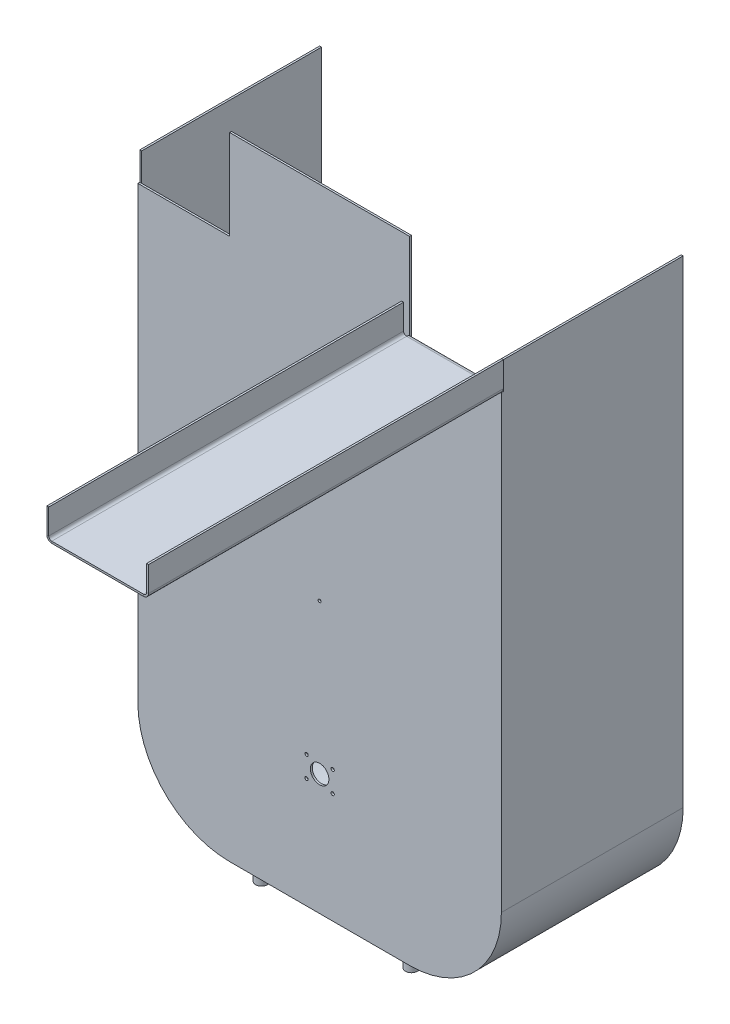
ISO-10303-21;
HEADER;
FILE_DESCRIPTION(('STEP AP214'),'2;1');
FILE_NAME('part.step','',(''),(''),'','','');
FILE_SCHEMA(('AUTOMOTIVE_DESIGN { 1 0 10303 214 1 1 1 1 }'));
ENDSEC;
DATA;
#1=APPLICATION_CONTEXT('core data for automotive mechanical design processes');
#2=APPLICATION_PROTOCOL_DEFINITION('international standard','automotive_design',2000,#1);
#3=PRODUCT_CONTEXT('',#1,'mechanical');
#4=PRODUCT('Part','Part','',(#3));
#5=PRODUCT_RELATED_PRODUCT_CATEGORY('part','',(#4));
#6=PRODUCT_DEFINITION_FORMATION('','',#4);
#7=PRODUCT_DEFINITION_CONTEXT('part definition',#1,'design');
#8=PRODUCT_DEFINITION('design','',#6,#7);
#9=PRODUCT_DEFINITION_SHAPE('','',#8);
#10=(LENGTH_UNIT() NAMED_UNIT(*) SI_UNIT(.MILLI.,.METRE.));
#11=(NAMED_UNIT(*) PLANE_ANGLE_UNIT() SI_UNIT($,.RADIAN.));
#12=(NAMED_UNIT(*) SI_UNIT($,.STERADIAN.) SOLID_ANGLE_UNIT());
#13=UNCERTAINTY_MEASURE_WITH_UNIT(LENGTH_MEASURE(1.E-05),#10,'distance_accuracy_value','');
#14=(GEOMETRIC_REPRESENTATION_CONTEXT(3) GLOBAL_UNCERTAINTY_ASSIGNED_CONTEXT((#13)) GLOBAL_UNIT_ASSIGNED_CONTEXT((#10,
#11,#12)) REPRESENTATION_CONTEXT('',''));
#15=CARTESIAN_POINT('',(0.,0.,0.));
#16=DIRECTION('',(0.,0.,1.));
#17=DIRECTION('',(1.,0.,0.));
#18=AXIS2_PLACEMENT_3D('',#15,#16,#17);
#19=CARTESIAN_POINT('',(0.,1800.,6.35));
#20=DIRECTION('',(0.,-1.,0.));
#21=DIRECTION('',(1.,0.,0.));
#22=AXIS2_PLACEMENT_3D('',#19,#20,#21);
#23=PLANE('',#22);
#24=DIRECTION('',(-1.,0.,0.));
#25=VECTOR('',#24,1.);
#26=CARTESIAN_POINT('',(0.,1800.,6.35));
#27=LINE('',#26,#25);
#28=CARTESIAN_POINT('',(-600.,1800.,6.35));
#29=VERTEX_POINT('',#28);
#30=CARTESIAN_POINT('',(-906.350000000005,1800.,6.35));
#31=VERTEX_POINT('',#30);
#32=EDGE_CURVE('E153',#29,#31,#27,.T.);
#33=ORIENTED_EDGE('',*,*,#32,.F.);
#34=DIRECTION('',(0.,0.,1.));
#35=VECTOR('',#34,1.);
#36=CARTESIAN_POINT('',(-600.,1800.,0.));
#37=LINE('',#36,#35);
#38=CARTESIAN_POINT('',(-600.,1800.,0.));
#39=VERTEX_POINT('',#38);
#40=EDGE_CURVE('E492',#39,#29,#37,.T.);
#41=ORIENTED_EDGE('',*,*,#40,.F.);
#42=DIRECTION('',(-1.,0.,0.));
#43=VECTOR('',#42,1.);
#44=CARTESIAN_POINT('',(0.,1800.,0.));
#45=LINE('',#44,#43);
#46=CARTESIAN_POINT('',(-900.000000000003,1800.,0.));
#47=VERTEX_POINT('',#46);
#48=EDGE_CURVE('E749',#39,#47,#45,.T.);
#49=ORIENTED_EDGE('',*,*,#48,.T.);
#50=DIRECTION('',(-1.,0.,0.));
#51=VECTOR('',#50,1.);
#52=CARTESIAN_POINT('',(-600.,1800.,0.));
#53=LINE('',#52,#51);
#54=CARTESIAN_POINT('',(-906.350000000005,1800.,0.));
#55=VERTEX_POINT('',#54);
#56=EDGE_CURVE('E511',#47,#55,#53,.T.);
#57=ORIENTED_EDGE('',*,*,#56,.T.);
#58=DIRECTION('',(0.,0.,1.));
#59=VECTOR('',#58,1.);
#60=CARTESIAN_POINT('',(-906.350000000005,1800.,-1832.14372935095));
#61=LINE('',#60,#59);
#62=EDGE_CURVE('E516',#55,#31,#61,.T.);
#63=ORIENTED_EDGE('',*,*,#62,.T.);
#64=EDGE_LOOP('',(#33,#41,#49,#57,#63));
#65=FACE_BOUND('',#64,.T.);
#66=ADVANCED_FACE('F139',(#65),#23,.F.);
#67=CARTESIAN_POINT('',(0.,-6.35,6.35));
#68=DIRECTION('',(0.,1.,0.));
#69=DIRECTION('',(-1.,0.,0.));
#70=AXIS2_PLACEMENT_3D('',#67,#68,#69);
#71=PLANE('',#70);
#72=DIRECTION('',(0.,0.,-1.));
#73=VECTOR('',#72,1.);
#74=CARTESIAN_POINT('',(-600.,-6.35000000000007,6.35));
#75=LINE('',#74,#73);
#76=CARTESIAN_POINT('',(-600.,-6.35000000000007,6.35));
#77=VERTEX_POINT('',#76);
#78=CARTESIAN_POINT('',(-600.,-6.35,-600.));
#79=VERTEX_POINT('',#78);
#80=EDGE_CURVE('E13',#77,#79,#75,.T.);
#81=ORIENTED_EDGE('',*,*,#80,.T.);
#82=DIRECTION('',(-1.,0.,0.));
#83=VECTOR('',#82,1.);
#84=CARTESIAN_POINT('',(0.,-6.35,-600.));
#85=LINE('',#84,#83);
#86=CARTESIAN_POINT('',(-1.4152861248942E-13,-6.34999999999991,-600.));
#87=VERTEX_POINT('',#86);
#88=EDGE_CURVE('E645',#87,#79,#85,.T.);
#89=ORIENTED_EDGE('',*,*,#88,.F.);
#90=DIRECTION('',(0.,0.,-1.));
#91=VECTOR('',#90,1.);
#92=CARTESIAN_POINT('',(0.,-6.35,6.35));
#93=LINE('',#92,#91);
#94=CARTESIAN_POINT('',(0.,-6.35,6.35));
#95=VERTEX_POINT('',#94);
#96=EDGE_CURVE('E146',#95,#87,#93,.T.);
#97=ORIENTED_EDGE('',*,*,#96,.F.);
#98=DIRECTION('',(1.,0.,0.));
#99=VECTOR('',#98,1.);
#100=CARTESIAN_POINT('',(0.,-6.35,6.35));
#101=LINE('',#100,#99);
#102=EDGE_CURVE('E751',#77,#95,#101,.T.);
#103=ORIENTED_EDGE('',*,*,#102,.F.);
#104=EDGE_LOOP('',(#81,#89,#97,#103));
#105=FACE_BOUND('',#104,.T.);
#106=CARTESIAN_POINT('',(-50.,-6.35,-550.));
#107=DIRECTION('',(0.,1.,0.));
#108=DIRECTION('',(0.,0.,1.));
#109=AXIS2_PLACEMENT_3D('',#106,#107,#108);
#110=CIRCLE('',#109,20.0000000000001);
#111=CARTESIAN_POINT('',(-50.,-6.35,-530.));
#112=VERTEX_POINT('',#111);
#113=EDGE_CURVE('E668',#112,#112,#110,.F.);
#114=ORIENTED_EDGE('',*,*,#113,.F.);
#115=EDGE_LOOP('',(#114));
#116=FACE_BOUND('',#115,.T.);
#117=CARTESIAN_POINT('',(-550.,-6.35,-50.));
#118=DIRECTION('',(0.,1.,0.));
#119=DIRECTION('',(0.,0.,1.));
#120=AXIS2_PLACEMENT_3D('',#117,#118,#119);
#121=CIRCLE('',#120,20.0000000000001);
#122=CARTESIAN_POINT('',(-550.,-6.35,-29.9999999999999));
#123=VERTEX_POINT('',#122);
#124=EDGE_CURVE('E660',#123,#123,#121,.F.);
#125=ORIENTED_EDGE('',*,*,#124,.F.);
#126=EDGE_LOOP('',(#125));
#127=FACE_BOUND('',#126,.T.);
#128=CARTESIAN_POINT('',(-150.,-6.35,-300.));
#129=DIRECTION('',(0.,1.,0.));
#130=DIRECTION('',(0.,0.,1.));
#131=AXIS2_PLACEMENT_3D('',#128,#129,#130);
#132=CIRCLE('',#131,5.00000000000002);
#133=CARTESIAN_POINT('',(-150.,-6.35,-295.));
#134=VERTEX_POINT('',#133);
#135=EDGE_CURVE('E615',#134,#134,#132,.T.);
#136=ORIENTED_EDGE('',*,*,#135,.T.);
#137=EDGE_LOOP('',(#136));
#138=FACE_BOUND('',#137,.T.);
#139=CARTESIAN_POINT('',(-450.,-6.35,-150.));
#140=DIRECTION('',(0.,1.,0.));
#141=DIRECTION('',(0.,0.,1.));
#142=AXIS2_PLACEMENT_3D('',#139,#140,#141);
#143=CIRCLE('',#142,4.99999999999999);
#144=CARTESIAN_POINT('',(-450.,-6.35,-145.));
#145=VERTEX_POINT('',#144);
#146=EDGE_CURVE('E621',#145,#145,#143,.T.);
#147=ORIENTED_EDGE('',*,*,#146,.T.);
#148=EDGE_LOOP('',(#147));
#149=FACE_BOUND('',#148,.T.);
#150=CARTESIAN_POINT('',(-450.,-6.35,-450.));
#151=DIRECTION('',(0.,1.,0.));
#152=DIRECTION('',(0.,0.,1.));
#153=AXIS2_PLACEMENT_3D('',#150,#151,#152);
#154=CIRCLE('',#153,4.99999999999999);
#155=CARTESIAN_POINT('',(-450.,-6.35,-445.));
#156=VERTEX_POINT('',#155);
#157=EDGE_CURVE('E627',#156,#156,#154,.T.);
#158=ORIENTED_EDGE('',*,*,#157,.T.);
#159=EDGE_LOOP('',(#158));
#160=FACE_BOUND('',#159,.T.);
#161=CARTESIAN_POINT('',(-550.,-6.35,-550.));
#162=DIRECTION('',(0.,1.,0.));
#163=DIRECTION('',(0.,0.,1.));
#164=AXIS2_PLACEMENT_3D('',#161,#162,#163);
#165=CIRCLE('',#164,20.0000000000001);
#166=CARTESIAN_POINT('',(-550.,-6.35,-530.));
#167=VERTEX_POINT('',#166);
#168=EDGE_CURVE('E665',#167,#167,#165,.F.);
#169=ORIENTED_EDGE('',*,*,#168,.F.);
#170=EDGE_LOOP('',(#169));
#171=FACE_BOUND('',#170,.T.);
#172=CARTESIAN_POINT('',(-50.,-6.35,-50.));
#173=DIRECTION('',(0.,1.,0.));
#174=DIRECTION('',(0.,0.,1.));
#175=AXIS2_PLACEMENT_3D('',#172,#173,#174);
#176=CIRCLE('',#175,20.0000000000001);
#177=CARTESIAN_POINT('',(-50.,-6.35,-29.9999999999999));
#178=VERTEX_POINT('',#177);
#179=EDGE_CURVE('E671',#178,#178,#176,.F.);
#180=ORIENTED_EDGE('',*,*,#179,.F.);
#181=EDGE_LOOP('',(#180));
#182=FACE_BOUND('',#181,.T.);
#183=ADVANCED_FACE('F764',(#105,#116,#127,#138,#149,#160,#171,#182),#71,.F.);
#184=CARTESIAN_POINT('',(0.,0.,6.35));
#185=DIRECTION('',(0.,0.,1.));
#186=DIRECTION('',(1.,0.,0.));
#187=AXIS2_PLACEMENT_3D('',#184,#185,#186);
#188=PLANE('',#187);
#189=CARTESIAN_POINT('',(-343.5,1361.825,6.35));
#190=DIRECTION('',(0.,0.,1.));
#191=DIRECTION('',(1.,0.,0.));
#192=AXIS2_PLACEMENT_3D('',#189,#190,#191);
#193=CIRCLE('',#192,5.49999999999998);
#194=CARTESIAN_POINT('',(-338.,1361.825,6.35));
#195=VERTEX_POINT('',#194);
#196=EDGE_CURVE('E704',#195,#195,#193,.T.);
#197=ORIENTED_EDGE('',*,*,#196,.F.);
#198=EDGE_LOOP('',(#197));
#199=FACE_BOUND('',#198,.T.);
#200=CARTESIAN_POINT('',(-256.5,1431.825,6.35));
#201=DIRECTION('',(0.,0.,1.));
#202=DIRECTION('',(1.,0.,0.));
#203=AXIS2_PLACEMENT_3D('',#200,#201,#202);
#204=CIRCLE('',#203,5.49999999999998);
#205=CARTESIAN_POINT('',(-251.,1431.825,6.35));
#206=VERTEX_POINT('',#205);
#207=EDGE_CURVE('E696',#206,#206,#204,.T.);
#208=ORIENTED_EDGE('',*,*,#207,.F.);
#209=EDGE_LOOP('',(#208));
#210=FACE_BOUND('',#209,.T.);
#211=CARTESIAN_POINT('',(-343.5,1431.825,6.35));
#212=DIRECTION('',(0.,0.,1.));
#213=DIRECTION('',(1.,0.,0.));
#214=AXIS2_PLACEMENT_3D('',#211,#212,#213);
#215=CIRCLE('',#214,5.49999999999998);
#216=CARTESIAN_POINT('',(-338.,1431.825,6.35));
#217=VERTEX_POINT('',#216);
#218=EDGE_CURVE('E703',#217,#217,#215,.T.);
#219=ORIENTED_EDGE('',*,*,#218,.F.);
#220=EDGE_LOOP('',(#219));
#221=FACE_BOUND('',#220,.T.);
#222=CARTESIAN_POINT('',(-256.5,1361.825,6.35));
#223=DIRECTION('',(0.,0.,1.));
#224=DIRECTION('',(1.,0.,0.));
#225=AXIS2_PLACEMENT_3D('',#222,#223,#224);
#226=CIRCLE('',#225,5.49999999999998);
#227=CARTESIAN_POINT('',(-251.,1361.825,6.35));
#228=VERTEX_POINT('',#227);
#229=EDGE_CURVE('E710',#228,#228,#226,.T.);
#230=ORIENTED_EDGE('',*,*,#229,.F.);
#231=EDGE_LOOP('',(#230));
#232=FACE_BOUND('',#231,.T.);
#233=CARTESIAN_POINT('',(-343.5,431.825,6.35));
#234=DIRECTION('',(0.,0.,1.));
#235=DIRECTION('',(-1.,0.,0.));
#236=AXIS2_PLACEMENT_3D('',#233,#234,#235);
#237=CIRCLE('',#236,5.49999999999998);
#238=CARTESIAN_POINT('',(-349.,431.825,6.35));
#239=VERTEX_POINT('',#238);
#240=EDGE_CURVE('E722',#239,#239,#237,.T.);
#241=ORIENTED_EDGE('',*,*,#240,.F.);
#242=EDGE_LOOP('',(#241));
#243=FACE_BOUND('',#242,.T.);
#244=CARTESIAN_POINT('',(-256.5,431.825,6.35));
#245=DIRECTION('',(0.,0.,1.));
#246=DIRECTION('',(-1.,0.,0.));
#247=AXIS2_PLACEMENT_3D('',#244,#245,#246);
#248=CIRCLE('',#247,5.49999999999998);
#249=CARTESIAN_POINT('',(-262.,431.825,6.35));
#250=VERTEX_POINT('',#249);
#251=EDGE_CURVE('E728',#250,#250,#248,.T.);
#252=ORIENTED_EDGE('',*,*,#251,.F.);
#253=EDGE_LOOP('',(#252));
#254=FACE_BOUND('',#253,.T.);
#255=CARTESIAN_POINT('',(-256.5,361.825,6.35));
#256=DIRECTION('',(0.,0.,1.));
#257=DIRECTION('',(-1.,0.,0.));
#258=AXIS2_PLACEMENT_3D('',#255,#256,#257);
#259=CIRCLE('',#258,5.49999999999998);
#260=CARTESIAN_POINT('',(-262.,361.825,6.35));
#261=VERTEX_POINT('',#260);
#262=EDGE_CURVE('E734',#261,#261,#259,.T.);
#263=ORIENTED_EDGE('',*,*,#262,.F.);
#264=EDGE_LOOP('',(#263));
#265=FACE_BOUND('',#264,.T.);
#266=CARTESIAN_POINT('',(-343.5,361.825,6.35));
#267=DIRECTION('',(0.,0.,1.));
#268=DIRECTION('',(-1.,0.,0.));
#269=AXIS2_PLACEMENT_3D('',#266,#267,#268);
#270=CIRCLE('',#269,5.49999999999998);
#271=CARTESIAN_POINT('',(-349.,361.825,6.35));
#272=VERTEX_POINT('',#271);
#273=EDGE_CURVE('E691',#272,#272,#270,.T.);
#274=ORIENTED_EDGE('',*,*,#273,.F.);
#275=EDGE_LOOP('',(#274));
#276=FACE_BOUND('',#275,.T.);
#277=CARTESIAN_POINT('',(-300.,396.825,6.35));
#278=DIRECTION('',(0.,0.,1.));
#279=DIRECTION('',(-1.,0.,0.));
#280=AXIS2_PLACEMENT_3D('',#277,#278,#279);
#281=CIRCLE('',#280,31.);
#282=CARTESIAN_POINT('',(-331.,396.825,6.35));
#283=VERTEX_POINT('',#282);
#284=EDGE_CURVE('E684',#283,#283,#281,.T.);
#285=ORIENTED_EDGE('',*,*,#284,.F.);
#286=EDGE_LOOP('',(#285));
#287=FACE_BOUND('',#286,.T.);
#288=CARTESIAN_POINT('',(-300.,896.825,6.35));
#289=DIRECTION('',(0.,0.,1.));
#290=DIRECTION('',(1.,0.,0.));
#291=AXIS2_PLACEMENT_3D('',#288,#289,#290);
#292=CIRCLE('',#291,4.99999999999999);
#293=CARTESIAN_POINT('',(-295.,896.825,6.35));
#294=VERTEX_POINT('',#293);
#295=EDGE_CURVE('E683',#294,#294,#292,.T.);
#296=ORIENTED_EDGE('',*,*,#295,.F.);
#297=EDGE_LOOP('',(#296));
#298=FACE_BOUND('',#297,.T.);
#299=CARTESIAN_POINT('',(-300.,1396.825,6.35));
#300=DIRECTION('',(0.,0.,1.));
#301=DIRECTION('',(1.,0.,0.));
#302=AXIS2_PLACEMENT_3D('',#299,#300,#301);
#303=CIRCLE('',#302,31.0000000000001);
#304=CARTESIAN_POINT('',(-269.,1396.825,6.35));
#305=VERTEX_POINT('',#304);
#306=EDGE_CURVE('E717',#305,#305,#303,.T.);
#307=ORIENTED_EDGE('',*,*,#306,.F.);
#308=EDGE_LOOP('',(#307));
#309=FACE_BOUND('',#308,.T.);
#310=ORIENTED_EDGE('',*,*,#102,.T.);
#311=CARTESIAN_POINT('',(-5.55111512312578E-13,300.000000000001,6.35));
#312=DIRECTION('',(0.,0.,1.));
#313=DIRECTION('',(1.,0.,0.));
#314=AXIS2_PLACEMENT_3D('',#311,#312,#313);
#315=CIRCLE('',#314,306.350000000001);
#316=CARTESIAN_POINT('',(306.35,299.999999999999,6.35));
#317=VERTEX_POINT('',#316);
#318=EDGE_CURVE('E674',#95,#317,#315,.T.);
#319=ORIENTED_EDGE('',*,*,#318,.T.);
#320=DIRECTION('',(0.,1.,0.));
#321=VECTOR('',#320,1.);
#322=CARTESIAN_POINT('',(306.350000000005,1800.,6.35));
#323=LINE('',#322,#321);
#324=CARTESIAN_POINT('',(306.350000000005,1800.,6.35));
#325=VERTEX_POINT('',#324);
#326=EDGE_CURVE('E675',#317,#325,#323,.T.);
#327=ORIENTED_EDGE('',*,*,#326,.T.);
#328=CARTESIAN_POINT('',(-1.11022302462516E-13,1800.,6.35));
#329=VERTEX_POINT('',#328);
#330=EDGE_CURVE('E161',#325,#329,#27,.T.);
#331=ORIENTED_EDGE('',*,*,#330,.T.);
#332=DIRECTION('',(0.,1.,0.));
#333=VECTOR('',#332,1.);
#334=CARTESIAN_POINT('',(0.,2100.,6.35));
#335=LINE('',#334,#333);
#336=CARTESIAN_POINT('',(0.,2100.,6.35));
#337=VERTEX_POINT('',#336);
#338=EDGE_CURVE('E495',#329,#337,#335,.T.);
#339=ORIENTED_EDGE('',*,*,#338,.T.);
#340=DIRECTION('',(-1.,0.,0.));
#341=VECTOR('',#340,1.);
#342=CARTESIAN_POINT('',(-600.,2100.,6.35));
#343=LINE('',#342,#341);
#344=CARTESIAN_POINT('',(-600.,2100.,6.35));
#345=VERTEX_POINT('',#344);
#346=EDGE_CURVE('E486',#337,#345,#343,.T.);
#347=ORIENTED_EDGE('',*,*,#346,.T.);
#348=DIRECTION('',(0.,-1.,0.));
#349=VECTOR('',#348,1.);
#350=CARTESIAN_POINT('',(-600.,2100.,6.35));
#351=LINE('',#350,#349);
#352=EDGE_CURVE('E473',#345,#29,#351,.T.);
#353=ORIENTED_EDGE('',*,*,#352,.T.);
#354=ORIENTED_EDGE('',*,*,#32,.T.);
#355=DIRECTION('',(0.,-1.,0.));
#356=VECTOR('',#355,1.);
#357=CARTESIAN_POINT('',(-906.350000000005,1800.,6.35));
#358=LINE('',#357,#356);
#359=CARTESIAN_POINT('',(-906.35,299.999999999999,6.35));
#360=VERTEX_POINT('',#359);
#361=EDGE_CURVE('E508',#31,#360,#358,.T.);
#362=ORIENTED_EDGE('',*,*,#361,.T.);
#363=CARTESIAN_POINT('',(-600.,300.,6.35));
#364=DIRECTION('',(0.,0.,1.));
#365=DIRECTION('',(-1.,0.,0.));
#366=AXIS2_PLACEMENT_3D('',#363,#364,#365);
#367=CIRCLE('',#366,306.35);
#368=EDGE_CURVE('E501',#360,#77,#367,.T.);
#369=ORIENTED_EDGE('',*,*,#368,.T.);
#370=EDGE_LOOP('',(#310,#319,#327,#331,#339,#347,#353,#354,#362,#369));
#371=FACE_BOUND('',#370,.T.);
#372=ADVANCED_FACE('F785',(#199,#210,#221,#232,#243,#254,#265,#276,#287,#298,#309,#371),#188,.T.);
#373=CARTESIAN_POINT('',(0.,0.,0.));
#374=DIRECTION('',(0.,0.,1.));
#375=DIRECTION('',(1.,0.,0.));
#376=AXIS2_PLACEMENT_3D('',#373,#374,#375);
#377=PLANE('',#376);
#378=CARTESIAN_POINT('',(-343.5,1361.825,0.));
#379=DIRECTION('',(0.,0.,1.));
#380=DIRECTION('',(1.,0.,0.));
#381=AXIS2_PLACEMENT_3D('',#378,#379,#380);
#382=CIRCLE('',#381,5.49999999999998);
#383=CARTESIAN_POINT('',(-338.,1361.825,0.));
#384=VERTEX_POINT('',#383);
#385=EDGE_CURVE('E700',#384,#384,#382,.F.);
#386=ORIENTED_EDGE('',*,*,#385,.F.);
#387=EDGE_LOOP('',(#386));
#388=FACE_BOUND('',#387,.T.);
#389=CARTESIAN_POINT('',(-256.5,1431.825,0.));
#390=DIRECTION('',(0.,0.,1.));
#391=DIRECTION('',(1.,0.,0.));
#392=AXIS2_PLACEMENT_3D('',#389,#390,#391);
#393=CIRCLE('',#392,5.49999999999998);
#394=CARTESIAN_POINT('',(-251.,1431.825,0.));
#395=VERTEX_POINT('',#394);
#396=EDGE_CURVE('E699',#395,#395,#393,.F.);
#397=ORIENTED_EDGE('',*,*,#396,.F.);
#398=EDGE_LOOP('',(#397));
#399=FACE_BOUND('',#398,.T.);
#400=CARTESIAN_POINT('',(-343.5,1431.825,0.));
#401=DIRECTION('',(0.,0.,1.));
#402=DIRECTION('',(1.,0.,0.));
#403=AXIS2_PLACEMENT_3D('',#400,#401,#402);
#404=CIRCLE('',#403,5.49999999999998);
#405=CARTESIAN_POINT('',(-338.,1431.825,0.));
#406=VERTEX_POINT('',#405);
#407=EDGE_CURVE('E714',#406,#406,#404,.F.);
#408=ORIENTED_EDGE('',*,*,#407,.F.);
#409=EDGE_LOOP('',(#408));
#410=FACE_BOUND('',#409,.T.);
#411=CARTESIAN_POINT('',(-256.5,1361.825,0.));
#412=DIRECTION('',(0.,0.,1.));
#413=DIRECTION('',(1.,0.,0.));
#414=AXIS2_PLACEMENT_3D('',#411,#412,#413);
#415=CIRCLE('',#414,5.49999999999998);
#416=CARTESIAN_POINT('',(-251.,1361.825,0.));
#417=VERTEX_POINT('',#416);
#418=EDGE_CURVE('E713',#417,#417,#415,.F.);
#419=ORIENTED_EDGE('',*,*,#418,.F.);
#420=EDGE_LOOP('',(#419));
#421=FACE_BOUND('',#420,.T.);
#422=CARTESIAN_POINT('',(-343.5,431.825,0.));
#423=DIRECTION('',(0.,0.,1.));
#424=DIRECTION('',(1.,0.,0.));
#425=AXIS2_PLACEMENT_3D('',#422,#423,#424);
#426=CIRCLE('',#425,5.49999999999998);
#427=CARTESIAN_POINT('',(-338.,431.825,0.));
#428=VERTEX_POINT('',#427);
#429=EDGE_CURVE('E707',#428,#428,#426,.F.);
#430=ORIENTED_EDGE('',*,*,#429,.F.);
#431=EDGE_LOOP('',(#430));
#432=FACE_BOUND('',#431,.T.);
#433=CARTESIAN_POINT('',(-256.5,431.825,0.));
#434=DIRECTION('',(0.,0.,1.));
#435=DIRECTION('',(1.,0.,0.));
#436=AXIS2_PLACEMENT_3D('',#433,#434,#435);
#437=CIRCLE('',#436,5.49999999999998);
#438=CARTESIAN_POINT('',(-251.,431.825,0.));
#439=VERTEX_POINT('',#438);
#440=EDGE_CURVE('E725',#439,#439,#437,.F.);
#441=ORIENTED_EDGE('',*,*,#440,.F.);
#442=EDGE_LOOP('',(#441));
#443=FACE_BOUND('',#442,.T.);
#444=CARTESIAN_POINT('',(-256.5,361.825,0.));
#445=DIRECTION('',(0.,0.,1.));
#446=DIRECTION('',(1.,0.,0.));
#447=AXIS2_PLACEMENT_3D('',#444,#445,#446);
#448=CIRCLE('',#447,5.49999999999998);
#449=CARTESIAN_POINT('',(-251.,361.825,0.));
#450=VERTEX_POINT('',#449);
#451=EDGE_CURVE('E731',#450,#450,#448,.F.);
#452=ORIENTED_EDGE('',*,*,#451,.F.);
#453=EDGE_LOOP('',(#452));
#454=FACE_BOUND('',#453,.T.);
#455=CARTESIAN_POINT('',(-343.5,361.825,0.));
#456=DIRECTION('',(0.,0.,1.));
#457=DIRECTION('',(1.,0.,0.));
#458=AXIS2_PLACEMENT_3D('',#455,#456,#457);
#459=CIRCLE('',#458,5.49999999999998);
#460=CARTESIAN_POINT('',(-338.,361.825,0.));
#461=VERTEX_POINT('',#460);
#462=EDGE_CURVE('E737',#461,#461,#459,.F.);
#463=ORIENTED_EDGE('',*,*,#462,.F.);
#464=EDGE_LOOP('',(#463));
#465=FACE_BOUND('',#464,.T.);
#466=CARTESIAN_POINT('',(-300.,396.825,0.));
#467=DIRECTION('',(0.,0.,1.));
#468=DIRECTION('',(1.,0.,0.));
#469=AXIS2_PLACEMENT_3D('',#466,#467,#468);
#470=CIRCLE('',#469,31.);
#471=CARTESIAN_POINT('',(-269.,396.825,0.));
#472=VERTEX_POINT('',#471);
#473=EDGE_CURVE('E687',#472,#472,#470,.F.);
#474=ORIENTED_EDGE('',*,*,#473,.F.);
#475=EDGE_LOOP('',(#474));
#476=FACE_BOUND('',#475,.T.);
#477=CARTESIAN_POINT('',(-300.,896.825,0.));
#478=DIRECTION('',(0.,0.,1.));
#479=DIRECTION('',(1.,0.,0.));
#480=AXIS2_PLACEMENT_3D('',#477,#478,#479);
#481=CIRCLE('',#480,4.99999999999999);
#482=CARTESIAN_POINT('',(-295.,896.825,0.));
#483=VERTEX_POINT('',#482);
#484=EDGE_CURVE('E688',#483,#483,#481,.F.);
#485=ORIENTED_EDGE('',*,*,#484,.F.);
#486=EDGE_LOOP('',(#485));
#487=FACE_BOUND('',#486,.T.);
#488=CARTESIAN_POINT('',(-300.,1396.825,0.));
#489=DIRECTION('',(0.,0.,1.));
#490=DIRECTION('',(1.,0.,0.));
#491=AXIS2_PLACEMENT_3D('',#488,#489,#490);
#492=CIRCLE('',#491,31.0000000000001);
#493=CARTESIAN_POINT('',(-269.,1396.825,0.));
#494=VERTEX_POINT('',#493);
#495=EDGE_CURVE('E746',#494,#494,#492,.F.);
#496=ORIENTED_EDGE('',*,*,#495,.F.);
#497=EDGE_LOOP('',(#496));
#498=FACE_BOUND('',#497,.T.);
#499=CARTESIAN_POINT('',(1.11022302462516E-13,300.,0.));
#500=DIRECTION('',(0.,0.,-1.));
#501=DIRECTION('',(-1.,0.,0.));
#502=AXIS2_PLACEMENT_3D('',#499,#500,#501);
#503=CIRCLE('',#502,300.);
#504=CARTESIAN_POINT('',(0.,0.,0.));
#505=VERTEX_POINT('',#504);
#506=CARTESIAN_POINT('',(300.,299.999999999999,-1.11022302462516E-13));
#507=VERTEX_POINT('',#506);
#508=EDGE_CURVE('E587',#505,#507,#503,.F.);
#509=ORIENTED_EDGE('',*,*,#508,.F.);
#510=DIRECTION('',(1.,0.,0.));
#511=VECTOR('',#510,1.);
#512=CARTESIAN_POINT('',(0.,0.,0.));
#513=LINE('',#512,#511);
#514=CARTESIAN_POINT('',(-600.,0.,0.));
#515=VERTEX_POINT('',#514);
#516=EDGE_CURVE('E649',#515,#505,#513,.T.);
#517=ORIENTED_EDGE('',*,*,#516,.F.);
#518=CARTESIAN_POINT('',(-600.,300.,1.01636428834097E-13));
#519=DIRECTION('',(0.,0.,1.));
#520=DIRECTION('',(1.,0.,0.));
#521=AXIS2_PLACEMENT_3D('',#518,#519,#520);
#522=CIRCLE('',#521,300.);
#523=CARTESIAN_POINT('',(-900.,299.999999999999,1.01636428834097E-13));
#524=VERTEX_POINT('',#523);
#525=EDGE_CURVE('E522',#524,#515,#522,.T.);
#526=ORIENTED_EDGE('',*,*,#525,.F.);
#527=DIRECTION('',(0.,-1.,0.));
#528=VECTOR('',#527,1.);
#529=CARTESIAN_POINT('',(-900.000000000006,1893.65,0.));
#530=LINE('',#529,#528);
#531=EDGE_CURVE('E535',#524,#47,#530,.F.);
#532=ORIENTED_EDGE('',*,*,#531,.T.);
#533=ORIENTED_EDGE('',*,*,#48,.F.);
#534=DIRECTION('',(0.,-1.,0.));
#535=VECTOR('',#534,1.);
#536=CARTESIAN_POINT('',(-600.,2100.,0.));
#537=LINE('',#536,#535);
#538=CARTESIAN_POINT('',(-600.,2100.,0.));
#539=VERTEX_POINT('',#538);
#540=EDGE_CURVE('E482',#539,#39,#537,.T.);
#541=ORIENTED_EDGE('',*,*,#540,.F.);
#542=DIRECTION('',(-1.,0.,0.));
#543=VECTOR('',#542,1.);
#544=CARTESIAN_POINT('',(-600.,2100.,0.));
#545=LINE('',#544,#543);
#546=CARTESIAN_POINT('',(0.,2100.,0.));
#547=VERTEX_POINT('',#546);
#548=EDGE_CURVE('E489',#547,#539,#545,.T.);
#549=ORIENTED_EDGE('',*,*,#548,.F.);
#550=DIRECTION('',(0.,1.,0.));
#551=VECTOR('',#550,1.);
#552=CARTESIAN_POINT('',(0.,2100.,0.));
#553=LINE('',#552,#551);
#554=CARTESIAN_POINT('',(-1.11022302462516E-13,1800.,0.));
#555=VERTEX_POINT('',#554);
#556=EDGE_CURVE('E485',#555,#547,#553,.T.);
#557=ORIENTED_EDGE('',*,*,#556,.F.);
#558=CARTESIAN_POINT('',(300.000000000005,1800.,7.7715611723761E-13));
#559=VERTEX_POINT('',#558);
#560=EDGE_CURVE('E755',#559,#555,#45,.T.);
#561=ORIENTED_EDGE('',*,*,#560,.F.);
#562=DIRECTION('',(0.,1.,0.));
#563=VECTOR('',#562,1.);
#564=CARTESIAN_POINT('',(299.999999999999,0.,0.));
#565=LINE('',#564,#563);
#566=EDGE_CURVE('E574',#559,#507,#565,.F.);
#567=ORIENTED_EDGE('',*,*,#566,.T.);
#568=EDGE_LOOP('',(#509,#517,#526,#532,#533,#541,#549,#557,#561,#567));
#569=FACE_BOUND('',#568,.T.);
#570=ADVANCED_FACE('F826',(#388,#399,#410,#421,#432,#443,#454,#465,#476,#487,#498,#569),#377,.F.);
#571=CARTESIAN_POINT('',(-300.,1396.825,-600.001));
#572=DIRECTION('',(0.,0.,1.));
#573=DIRECTION('',(1.,0.,0.));
#574=AXIS2_PLACEMENT_3D('',#571,#572,#573);
#575=CYLINDRICAL_SURFACE('',#574,31.0000000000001);
#576=ORIENTED_EDGE('',*,*,#306,.T.);
#577=EDGE_LOOP('',(#576));
#578=FACE_BOUND('',#577,.T.);
#579=ORIENTED_EDGE('',*,*,#495,.T.);
#580=EDGE_LOOP('',(#579));
#581=FACE_BOUND('',#580,.T.);
#582=ADVANCED_FACE('F935',(#578,#581),#575,.F.);
#583=CARTESIAN_POINT('',(-300.,896.825,-600.001));
#584=DIRECTION('',(0.,0.,1.));
#585=DIRECTION('',(1.,0.,0.));
#586=AXIS2_PLACEMENT_3D('',#583,#584,#585);
#587=CYLINDRICAL_SURFACE('',#586,4.99999999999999);
#588=ORIENTED_EDGE('',*,*,#295,.T.);
#589=EDGE_LOOP('',(#588));
#590=FACE_BOUND('',#589,.T.);
#591=ORIENTED_EDGE('',*,*,#484,.T.);
#592=EDGE_LOOP('',(#591));
#593=FACE_BOUND('',#592,.T.);
#594=ADVANCED_FACE('F940',(#590,#593),#587,.F.);
#595=CARTESIAN_POINT('',(-300.,396.825,-600.001));
#596=DIRECTION('',(0.,0.,1.));
#597=DIRECTION('',(1.,0.,0.));
#598=AXIS2_PLACEMENT_3D('',#595,#596,#597);
#599=CYLINDRICAL_SURFACE('',#598,31.);
#600=ORIENTED_EDGE('',*,*,#284,.T.);
#601=EDGE_LOOP('',(#600));
#602=FACE_BOUND('',#601,.T.);
#603=ORIENTED_EDGE('',*,*,#473,.T.);
#604=EDGE_LOOP('',(#603));
#605=FACE_BOUND('',#604,.T.);
#606=ADVANCED_FACE('F946',(#602,#605),#599,.F.);
#607=CARTESIAN_POINT('',(-343.5,361.825,-600.001));
#608=DIRECTION('',(0.,0.,1.));
#609=DIRECTION('',(1.,0.,0.));
#610=AXIS2_PLACEMENT_3D('',#607,#608,#609);
#611=CYLINDRICAL_SURFACE('',#610,5.49999999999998);
#612=ORIENTED_EDGE('',*,*,#273,.T.);
#613=EDGE_LOOP('',(#612));
#614=FACE_BOUND('',#613,.T.);
#615=ORIENTED_EDGE('',*,*,#462,.T.);
#616=EDGE_LOOP('',(#615));
#617=FACE_BOUND('',#616,.T.);
#618=ADVANCED_FACE('F942',(#614,#617),#611,.F.);
#619=CARTESIAN_POINT('',(-256.5,361.825,-600.001));
#620=DIRECTION('',(0.,0.,1.));
#621=DIRECTION('',(1.,0.,0.));
#622=AXIS2_PLACEMENT_3D('',#619,#620,#621);
#623=CYLINDRICAL_SURFACE('',#622,5.49999999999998);
#624=ORIENTED_EDGE('',*,*,#262,.T.);
#625=EDGE_LOOP('',(#624));
#626=FACE_BOUND('',#625,.T.);
#627=ORIENTED_EDGE('',*,*,#451,.T.);
#628=EDGE_LOOP('',(#627));
#629=FACE_BOUND('',#628,.T.);
#630=ADVANCED_FACE('F945',(#626,#629),#623,.F.);
#631=CARTESIAN_POINT('',(-256.5,431.825,-600.001));
#632=DIRECTION('',(0.,0.,1.));
#633=DIRECTION('',(1.,0.,0.));
#634=AXIS2_PLACEMENT_3D('',#631,#632,#633);
#635=CYLINDRICAL_SURFACE('',#634,5.49999999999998);
#636=ORIENTED_EDGE('',*,*,#251,.T.);
#637=EDGE_LOOP('',(#636));
#638=FACE_BOUND('',#637,.T.);
#639=ORIENTED_EDGE('',*,*,#440,.T.);
#640=EDGE_LOOP('',(#639));
#641=FACE_BOUND('',#640,.T.);
#642=ADVANCED_FACE('F950',(#638,#641),#635,.F.);
#643=CARTESIAN_POINT('',(-343.5,431.825,-600.001));
#644=DIRECTION('',(0.,0.,1.));
#645=DIRECTION('',(1.,0.,0.));
#646=AXIS2_PLACEMENT_3D('',#643,#644,#645);
#647=CYLINDRICAL_SURFACE('',#646,5.49999999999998);
#648=ORIENTED_EDGE('',*,*,#240,.T.);
#649=EDGE_LOOP('',(#648));
#650=FACE_BOUND('',#649,.T.);
#651=ORIENTED_EDGE('',*,*,#429,.T.);
#652=EDGE_LOOP('',(#651));
#653=FACE_BOUND('',#652,.T.);
#654=ADVANCED_FACE('F954',(#650,#653),#647,.F.);
#655=CARTESIAN_POINT('',(-256.5,1361.825,-600.001));
#656=DIRECTION('',(0.,0.,1.));
#657=DIRECTION('',(1.,0.,0.));
#658=AXIS2_PLACEMENT_3D('',#655,#656,#657);
#659=CYLINDRICAL_SURFACE('',#658,5.49999999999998);
#660=ORIENTED_EDGE('',*,*,#229,.T.);
#661=EDGE_LOOP('',(#660));
#662=FACE_BOUND('',#661,.T.);
#663=ORIENTED_EDGE('',*,*,#418,.T.);
#664=EDGE_LOOP('',(#663));
#665=FACE_BOUND('',#664,.T.);
#666=ADVANCED_FACE('F958',(#662,#665),#659,.F.);
#667=CARTESIAN_POINT('',(-343.5,1431.825,-600.001));
#668=DIRECTION('',(0.,0.,1.));
#669=DIRECTION('',(1.,0.,0.));
#670=AXIS2_PLACEMENT_3D('',#667,#668,#669);
#671=CYLINDRICAL_SURFACE('',#670,5.49999999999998);
#672=ORIENTED_EDGE('',*,*,#218,.T.);
#673=EDGE_LOOP('',(#672));
#674=FACE_BOUND('',#673,.T.);
#675=ORIENTED_EDGE('',*,*,#407,.T.);
#676=EDGE_LOOP('',(#675));
#677=FACE_BOUND('',#676,.T.);
#678=ADVANCED_FACE('F960',(#674,#677),#671,.F.);
#679=CARTESIAN_POINT('',(-256.5,1431.825,-600.001));
#680=DIRECTION('',(0.,0.,1.));
#681=DIRECTION('',(1.,0.,0.));
#682=AXIS2_PLACEMENT_3D('',#679,#680,#681);
#683=CYLINDRICAL_SURFACE('',#682,5.49999999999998);
#684=ORIENTED_EDGE('',*,*,#207,.T.);
#685=EDGE_LOOP('',(#684));
#686=FACE_BOUND('',#685,.T.);
#687=ORIENTED_EDGE('',*,*,#396,.T.);
#688=EDGE_LOOP('',(#687));
#689=FACE_BOUND('',#688,.T.);
#690=ADVANCED_FACE('F963',(#686,#689),#683,.F.);
#691=CARTESIAN_POINT('',(-343.5,1361.825,-600.001));
#692=DIRECTION('',(0.,0.,1.));
#693=DIRECTION('',(1.,0.,0.));
#694=AXIS2_PLACEMENT_3D('',#691,#692,#693);
#695=CYLINDRICAL_SURFACE('',#694,5.49999999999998);
#696=ORIENTED_EDGE('',*,*,#196,.T.);
#697=EDGE_LOOP('',(#696));
#698=FACE_BOUND('',#697,.T.);
#699=ORIENTED_EDGE('',*,*,#385,.T.);
#700=EDGE_LOOP('',(#699));
#701=FACE_BOUND('',#700,.T.);
#702=ADVANCED_FACE('F968',(#698,#701),#695,.F.);
#703=CARTESIAN_POINT('',(306.350000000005,1800.,-1832.14372935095));
#704=DIRECTION('',(1.,0.,0.));
#705=DIRECTION('',(0.,1.,0.));
#706=AXIS2_PLACEMENT_3D('',#703,#704,#705);
#707=PLANE('',#706);
#708=DIRECTION('',(0.,0.,1.));
#709=VECTOR('',#708,1.);
#710=CARTESIAN_POINT('',(306.35,299.999999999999,-1832.14372935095));
#711=LINE('',#710,#709);
#712=CARTESIAN_POINT('',(306.35,299.999999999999,-600.));
#713=VERTEX_POINT('',#712);
#714=EDGE_CURVE('E681',#713,#317,#711,.T.);
#715=ORIENTED_EDGE('',*,*,#714,.F.);
#716=DIRECTION('',(0.,1.,0.));
#717=VECTOR('',#716,1.);
#718=CARTESIAN_POINT('',(306.349999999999,0.,-600.));
#719=LINE('',#718,#717);
#720=CARTESIAN_POINT('',(306.350000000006,1893.65,-600.));
#721=VERTEX_POINT('',#720);
#722=EDGE_CURVE('E569',#713,#721,#719,.T.);
#723=ORIENTED_EDGE('',*,*,#722,.T.);
#724=DIRECTION('',(0.,0.,1.));
#725=VECTOR('',#724,1.);
#726=CARTESIAN_POINT('',(306.350000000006,1893.65,0.));
#727=LINE('',#726,#725);
#728=CARTESIAN_POINT('',(306.350000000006,1893.65,0.));
#729=VERTEX_POINT('',#728);
#730=EDGE_CURVE('E567',#721,#729,#727,.T.);
#731=ORIENTED_EDGE('',*,*,#730,.T.);
#732=DIRECTION('',(0.,-1.,0.));
#733=VECTOR('',#732,1.);
#734=CARTESIAN_POINT('',(306.349999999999,0.,0.));
#735=LINE('',#734,#733);
#736=CARTESIAN_POINT('',(306.350000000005,1800.,0.));
#737=VERTEX_POINT('',#736);
#738=EDGE_CURVE('E564',#729,#737,#735,.T.);
#739=ORIENTED_EDGE('',*,*,#738,.T.);
#740=DIRECTION('',(0.,0.,1.));
#741=VECTOR('',#740,1.);
#742=CARTESIAN_POINT('',(306.350000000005,1800.,-1832.14372935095));
#743=LINE('',#742,#741);
#744=EDGE_CURVE('E677',#737,#325,#743,.T.);
#745=ORIENTED_EDGE('',*,*,#744,.T.);
#746=ORIENTED_EDGE('',*,*,#326,.F.);
#747=EDGE_LOOP('',(#715,#723,#731,#739,#745,#746));
#748=FACE_BOUND('',#747,.T.);
#749=ADVANCED_FACE('F781',(#748),#707,.T.);
#750=CARTESIAN_POINT('',(-5.55111512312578E-13,300.000000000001,-1832.14372935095));
#751=DIRECTION('',(0.,0.,1.));
#752=DIRECTION('',(1.,0.,0.));
#753=AXIS2_PLACEMENT_3D('',#750,#751,#752);
#754=CYLINDRICAL_SURFACE('',#753,306.350000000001);
#755=ORIENTED_EDGE('',*,*,#96,.T.);
#756=CARTESIAN_POINT('',(-1.11022302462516E-13,300.,-600.));
#757=DIRECTION('',(0.,0.,-1.));
#758=DIRECTION('',(-1.,0.,0.));
#759=AXIS2_PLACEMENT_3D('',#756,#757,#758);
#760=CIRCLE('',#759,306.35);
#761=EDGE_CURVE('E583',#713,#87,#760,.T.);
#762=ORIENTED_EDGE('',*,*,#761,.F.);
#763=ORIENTED_EDGE('',*,*,#714,.T.);
#764=ORIENTED_EDGE('',*,*,#318,.F.);
#765=EDGE_LOOP('',(#755,#762,#763,#764));
#766=FACE_BOUND('',#765,.T.);
#767=ADVANCED_FACE('F761',(#766),#754,.T.);
#768=CARTESIAN_POINT('',(306.349999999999,0.,0.));
#769=DIRECTION('',(0.,0.,-1.));
#770=DIRECTION('',(-1.,0.,0.));
#771=AXIS2_PLACEMENT_3D('',#768,#769,#770);
#772=PLANE('',#771);
#773=CARTESIAN_POINT('',(300.000000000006,1893.65,0.));
#774=VERTEX_POINT('',#773);
#775=EDGE_CURVE('E571',#774,#559,#565,.F.);
#776=ORIENTED_EDGE('',*,*,#775,.T.);
#777=EDGE_CURVE('E753',#737,#559,#45,.T.);
#778=ORIENTED_EDGE('',*,*,#777,.F.);
#779=ORIENTED_EDGE('',*,*,#738,.F.);
#780=DIRECTION('',(-1.,0.,0.));
#781=VECTOR('',#780,1.);
#782=CARTESIAN_POINT('',(306.350000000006,1893.65,0.));
#783=LINE('',#782,#781);
#784=EDGE_CURVE('E561',#729,#774,#783,.T.);
#785=ORIENTED_EDGE('',*,*,#784,.T.);
#786=EDGE_LOOP('',(#776,#778,#779,#785));
#787=FACE_BOUND('',#786,.T.);
#788=ADVANCED_FACE('F839',(#787),#772,.F.);
#789=CARTESIAN_POINT('',(0.,-6.35,-600.));
#790=DIRECTION('',(0.,0.,-1.));
#791=DIRECTION('',(-1.,0.,0.));
#792=AXIS2_PLACEMENT_3D('',#789,#790,#791);
#793=PLANE('',#792);
#794=DIRECTION('',(-1.,0.,0.));
#795=VECTOR('',#794,1.);
#796=CARTESIAN_POINT('',(0.,0.,-600.));
#797=LINE('',#796,#795);
#798=CARTESIAN_POINT('',(0.,0.,-600.));
#799=VERTEX_POINT('',#798);
#800=CARTESIAN_POINT('',(-600.,0.,-600.));
#801=VERTEX_POINT('',#800);
#802=EDGE_CURVE('E652',#799,#801,#797,.T.);
#803=ORIENTED_EDGE('',*,*,#802,.F.);
#804=DIRECTION('',(0.,1.,0.));
#805=VECTOR('',#804,1.);
#806=CARTESIAN_POINT('',(0.,-6.35,-600.));
#807=LINE('',#806,#805);
#808=EDGE_CURVE('E648',#87,#799,#807,.T.);
#809=ORIENTED_EDGE('',*,*,#808,.F.);
#810=ORIENTED_EDGE('',*,*,#88,.T.);
#811=DIRECTION('',(0.,1.,0.));
#812=VECTOR('',#811,1.);
#813=CARTESIAN_POINT('',(-600.,-6.35,-600.));
#814=LINE('',#813,#812);
#815=EDGE_CURVE('E658',#79,#801,#814,.T.);
#816=ORIENTED_EDGE('',*,*,#815,.T.);
#817=EDGE_LOOP('',(#803,#809,#810,#816));
#818=FACE_BOUND('',#817,.T.);
#819=ADVANCED_FACE('F769',(#818),#793,.T.);
#820=CARTESIAN_POINT('',(0.,0.,0.));
#821=DIRECTION('',(0.,1.,0.));
#822=DIRECTION('',(0.,0.,1.));
#823=AXIS2_PLACEMENT_3D('',#820,#821,#822);
#824=PLANE('',#823);
#825=CARTESIAN_POINT('',(-150.,0.,-300.));
#826=DIRECTION('',(0.,1.,0.));
#827=DIRECTION('',(0.,0.,1.));
#828=AXIS2_PLACEMENT_3D('',#825,#826,#827);
#829=CIRCLE('',#828,5.00000000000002);
#830=CARTESIAN_POINT('',(-150.,0.,-295.));
#831=VERTEX_POINT('',#830);
#832=EDGE_CURVE('E614',#831,#831,#829,.T.);
#833=ORIENTED_EDGE('',*,*,#832,.F.);
#834=EDGE_LOOP('',(#833));
#835=FACE_BOUND('',#834,.T.);
#836=CARTESIAN_POINT('',(-450.,0.,-150.));
#837=DIRECTION('',(0.,1.,0.));
#838=DIRECTION('',(0.,0.,1.));
#839=AXIS2_PLACEMENT_3D('',#836,#837,#838);
#840=CIRCLE('',#839,4.99999999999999);
#841=CARTESIAN_POINT('',(-450.,0.,-145.));
#842=VERTEX_POINT('',#841);
#843=EDGE_CURVE('E618',#842,#842,#840,.T.);
#844=ORIENTED_EDGE('',*,*,#843,.F.);
#845=EDGE_LOOP('',(#844));
#846=FACE_BOUND('',#845,.T.);
#847=CARTESIAN_POINT('',(-450.,0.,-450.));
#848=DIRECTION('',(0.,1.,0.));
#849=DIRECTION('',(0.,0.,1.));
#850=AXIS2_PLACEMENT_3D('',#847,#848,#849);
#851=CIRCLE('',#850,4.99999999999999);
#852=CARTESIAN_POINT('',(-450.,0.,-445.));
#853=VERTEX_POINT('',#852);
#854=EDGE_CURVE('E624',#853,#853,#851,.T.);
#855=ORIENTED_EDGE('',*,*,#854,.F.);
#856=EDGE_LOOP('',(#855));
#857=FACE_BOUND('',#856,.T.);
#858=CARTESIAN_POINT('',(-550.,0.,-50.));
#859=DIRECTION('',(0.,1.,0.));
#860=DIRECTION('',(0.,0.,1.));
#861=AXIS2_PLACEMENT_3D('',#858,#859,#860);
#862=CIRCLE('',#861,5.00000000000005);
#863=CARTESIAN_POINT('',(-550.,0.,-44.9999999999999));
#864=VERTEX_POINT('',#863);
#865=EDGE_CURVE('E630',#864,#864,#862,.T.);
#866=ORIENTED_EDGE('',*,*,#865,.F.);
#867=EDGE_LOOP('',(#866));
#868=FACE_BOUND('',#867,.T.);
#869=CARTESIAN_POINT('',(-50.,0.,-50.));
#870=DIRECTION('',(0.,1.,0.));
#871=DIRECTION('',(0.,0.,1.));
#872=AXIS2_PLACEMENT_3D('',#869,#870,#871);
#873=CIRCLE('',#872,5.);
#874=CARTESIAN_POINT('',(-50.,0.,-45.));
#875=VERTEX_POINT('',#874);
#876=EDGE_CURVE('E635',#875,#875,#873,.T.);
#877=ORIENTED_EDGE('',*,*,#876,.F.);
#878=EDGE_LOOP('',(#877));
#879=FACE_BOUND('',#878,.T.);
#880=CARTESIAN_POINT('',(-50.,0.,-550.));
#881=DIRECTION('',(0.,1.,0.));
#882=DIRECTION('',(0.,0.,1.));
#883=AXIS2_PLACEMENT_3D('',#880,#881,#882);
#884=CIRCLE('',#883,5.);
#885=CARTESIAN_POINT('',(-50.,0.,-545.));
#886=VERTEX_POINT('',#885);
#887=EDGE_CURVE('E638',#886,#886,#884,.T.);
#888=ORIENTED_EDGE('',*,*,#887,.F.);
#889=EDGE_LOOP('',(#888));
#890=FACE_BOUND('',#889,.T.);
#891=CARTESIAN_POINT('',(-550.,0.,-550.));
#892=DIRECTION('',(0.,1.,0.));
#893=DIRECTION('',(0.,0.,1.));
#894=AXIS2_PLACEMENT_3D('',#891,#892,#893);
#895=CIRCLE('',#894,5.00000000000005);
#896=CARTESIAN_POINT('',(-550.,0.,-545.));
#897=VERTEX_POINT('',#896);
#898=EDGE_CURVE('E641',#897,#897,#895,.T.);
#899=ORIENTED_EDGE('',*,*,#898,.F.);
#900=EDGE_LOOP('',(#899));
#901=FACE_BOUND('',#900,.T.);
#902=ORIENTED_EDGE('',*,*,#516,.T.);
#903=DIRECTION('',(0.,0.,-1.));
#904=VECTOR('',#903,1.);
#905=CARTESIAN_POINT('',(0.,0.,-360.));
#906=LINE('',#905,#904);
#907=EDGE_CURVE('E644',#505,#799,#906,.T.);
#908=ORIENTED_EDGE('',*,*,#907,.T.);
#909=ORIENTED_EDGE('',*,*,#802,.T.);
#910=DIRECTION('',(0.,0.,1.));
#911=VECTOR('',#910,1.);
#912=CARTESIAN_POINT('',(-600.,0.,0.));
#913=LINE('',#912,#911);
#914=EDGE_CURVE('E655',#801,#515,#913,.T.);
#915=ORIENTED_EDGE('',*,*,#914,.T.);
#916=EDGE_LOOP('',(#902,#908,#909,#915));
#917=FACE_BOUND('',#916,.T.);
#918=ADVANCED_FACE('F818',(#835,#846,#857,#868,#879,#890,#901,#917),#824,.T.);
#919=CARTESIAN_POINT('',(-550.,-6.35,-550.));
#920=DIRECTION('',(0.,1.,0.));
#921=DIRECTION('',(0.,0.,1.));
#922=AXIS2_PLACEMENT_3D('',#919,#920,#921);
#923=CYLINDRICAL_SURFACE('',#922,5.00000000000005);
#924=ORIENTED_EDGE('',*,*,#898,.T.);
#925=EDGE_LOOP('',(#924));
#926=FACE_BOUND('',#925,.T.);
#927=CARTESIAN_POINT('',(-550.,-66.35,-550.));
#928=DIRECTION('',(0.,-1.,0.));
#929=DIRECTION('',(0.,0.,1.));
#930=AXIS2_PLACEMENT_3D('',#927,#928,#929);
#931=CIRCLE('',#930,5.00000000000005);
#932=CARTESIAN_POINT('',(-550.,-66.35,-545.));
#933=VERTEX_POINT('',#932);
#934=EDGE_CURVE('E602',#933,#933,#931,.T.);
#935=ORIENTED_EDGE('',*,*,#934,.T.);
#936=EDGE_LOOP('',(#935));
#937=FACE_BOUND('',#936,.T.);
#938=ADVANCED_FACE('F989',(#926,#937),#923,.F.);
#939=CARTESIAN_POINT('',(-50.,-6.35,-550.));
#940=DIRECTION('',(0.,1.,0.));
#941=DIRECTION('',(0.,0.,1.));
#942=AXIS2_PLACEMENT_3D('',#939,#940,#941);
#943=CYLINDRICAL_SURFACE('',#942,5.);
#944=ORIENTED_EDGE('',*,*,#887,.T.);
#945=EDGE_LOOP('',(#944));
#946=FACE_BOUND('',#945,.T.);
#947=CARTESIAN_POINT('',(-50.,-66.35,-550.));
#948=DIRECTION('',(0.,-1.,0.));
#949=DIRECTION('',(0.,0.,-1.));
#950=AXIS2_PLACEMENT_3D('',#947,#948,#949);
#951=CIRCLE('',#950,5.00000000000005);
#952=CARTESIAN_POINT('',(-50.,-66.35,-555.));
#953=VERTEX_POINT('',#952);
#954=EDGE_CURVE('E596',#953,#953,#951,.T.);
#955=ORIENTED_EDGE('',*,*,#954,.T.);
#956=EDGE_LOOP('',(#955));
#957=FACE_BOUND('',#956,.T.);
#958=ADVANCED_FACE('F993',(#946,#957),#943,.F.);
#959=CARTESIAN_POINT('',(-50.,-6.35,-50.));
#960=DIRECTION('',(0.,1.,0.));
#961=DIRECTION('',(0.,0.,1.));
#962=AXIS2_PLACEMENT_3D('',#959,#960,#961);
#963=CYLINDRICAL_SURFACE('',#962,5.);
#964=ORIENTED_EDGE('',*,*,#876,.T.);
#965=EDGE_LOOP('',(#964));
#966=FACE_BOUND('',#965,.T.);
#967=CARTESIAN_POINT('',(-50.,-66.35,-50.));
#968=DIRECTION('',(0.,-1.,0.));
#969=DIRECTION('',(0.,0.,1.));
#970=AXIS2_PLACEMENT_3D('',#967,#968,#969);
#971=CIRCLE('',#970,5.00000000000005);
#972=CARTESIAN_POINT('',(-50.,-66.35,-44.9999999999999));
#973=VERTEX_POINT('',#972);
#974=EDGE_CURVE('E586',#973,#973,#971,.T.);
#975=ORIENTED_EDGE('',*,*,#974,.T.);
#976=EDGE_LOOP('',(#975));
#977=FACE_BOUND('',#976,.T.);
#978=ADVANCED_FACE('F997',(#966,#977),#963,.F.);
#979=CARTESIAN_POINT('',(-550.,-6.35,-50.));
#980=DIRECTION('',(0.,1.,0.));
#981=DIRECTION('',(0.,0.,1.));
#982=AXIS2_PLACEMENT_3D('',#979,#980,#981);
#983=CYLINDRICAL_SURFACE('',#982,5.00000000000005);
#984=ORIENTED_EDGE('',*,*,#865,.T.);
#985=EDGE_LOOP('',(#984));
#986=FACE_BOUND('',#985,.T.);
#987=CARTESIAN_POINT('',(-550.,-66.35,-50.));
#988=DIRECTION('',(0.,-1.,0.));
#989=DIRECTION('',(0.,0.,-1.));
#990=AXIS2_PLACEMENT_3D('',#987,#988,#989);
#991=CIRCLE('',#990,5.00000000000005);
#992=CARTESIAN_POINT('',(-550.,-66.35,-55.));
#993=VERTEX_POINT('',#992);
#994=EDGE_CURVE('E608',#993,#993,#991,.T.);
#995=ORIENTED_EDGE('',*,*,#994,.T.);
#996=EDGE_LOOP('',(#995));
#997=FACE_BOUND('',#996,.T.);
#998=ADVANCED_FACE('F1001',(#986,#997),#983,.F.);
#999=CARTESIAN_POINT('',(-450.,-6.35,-450.));
#1000=DIRECTION('',(0.,1.,0.));
#1001=DIRECTION('',(0.,0.,1.));
#1002=AXIS2_PLACEMENT_3D('',#999,#1000,#1001);
#1003=CYLINDRICAL_SURFACE('',#1002,4.99999999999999);
#1004=ORIENTED_EDGE('',*,*,#157,.F.);
#1005=EDGE_LOOP('',(#1004));
#1006=FACE_BOUND('',#1005,.T.);
#1007=ORIENTED_EDGE('',*,*,#854,.T.);
#1008=EDGE_LOOP('',(#1007));
#1009=FACE_BOUND('',#1008,.T.);
#1010=ADVANCED_FACE('F1005',(#1006,#1009),#1003,.F.);
#1011=CARTESIAN_POINT('',(-450.,-6.35,-150.));
#1012=DIRECTION('',(0.,1.,0.));
#1013=DIRECTION('',(0.,0.,1.));
#1014=AXIS2_PLACEMENT_3D('',#1011,#1012,#1013);
#1015=CYLINDRICAL_SURFACE('',#1014,4.99999999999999);
#1016=ORIENTED_EDGE('',*,*,#146,.F.);
#1017=EDGE_LOOP('',(#1016));
#1018=FACE_BOUND('',#1017,.T.);
#1019=ORIENTED_EDGE('',*,*,#843,.T.);
#1020=EDGE_LOOP('',(#1019));
#1021=FACE_BOUND('',#1020,.T.);
#1022=ADVANCED_FACE('F1009',(#1018,#1021),#1015,.F.);
#1023=CARTESIAN_POINT('',(-150.,-6.35,-300.));
#1024=DIRECTION('',(0.,1.,0.));
#1025=DIRECTION('',(0.,0.,1.));
#1026=AXIS2_PLACEMENT_3D('',#1023,#1024,#1025);
#1027=CYLINDRICAL_SURFACE('',#1026,5.00000000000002);
#1028=ORIENTED_EDGE('',*,*,#135,.F.);
#1029=EDGE_LOOP('',(#1028));
#1030=FACE_BOUND('',#1029,.T.);
#1031=ORIENTED_EDGE('',*,*,#832,.T.);
#1032=EDGE_LOOP('',(#1031));
#1033=FACE_BOUND('',#1032,.T.);
#1034=ADVANCED_FACE('F1013',(#1030,#1033),#1027,.F.);
#1035=CARTESIAN_POINT('',(-550.,-66.35,-50.));
#1036=DIRECTION('',(0.,-1.,0.));
#1037=DIRECTION('',(0.,0.,-1.));
#1038=AXIS2_PLACEMENT_3D('',#1035,#1036,#1037);
#1039=PLANE('',#1038);
#1040=CARTESIAN_POINT('',(-550.,-66.35,-50.));
#1041=DIRECTION('',(0.,-1.,0.));
#1042=DIRECTION('',(0.,0.,-1.));
#1043=AXIS2_PLACEMENT_3D('',#1040,#1041,#1042);
#1044=CIRCLE('',#1043,20.0000000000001);
#1045=CARTESIAN_POINT('',(-550.,-66.35,-70.0000000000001));
#1046=VERTEX_POINT('',#1045);
#1047=EDGE_CURVE('E611',#1046,#1046,#1044,.T.);
#1048=ORIENTED_EDGE('',*,*,#1047,.T.);
#1049=EDGE_LOOP('',(#1048));
#1050=FACE_BOUND('',#1049,.T.);
#1051=ORIENTED_EDGE('',*,*,#994,.F.);
#1052=EDGE_LOOP('',(#1051));
#1053=FACE_BOUND('',#1052,.T.);
#1054=ADVANCED_FACE('F1017',(#1050,#1053),#1039,.T.);
#1055=CARTESIAN_POINT('',(-550.,-66.35,-50.));
#1056=DIRECTION('',(0.,1.,0.));
#1057=DIRECTION('',(0.,0.,1.));
#1058=AXIS2_PLACEMENT_3D('',#1055,#1056,#1057);
#1059=CYLINDRICAL_SURFACE('',#1058,20.0000000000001);
#1060=ORIENTED_EDGE('',*,*,#1047,.F.);
#1061=EDGE_LOOP('',(#1060));
#1062=FACE_BOUND('',#1061,.T.);
#1063=ORIENTED_EDGE('',*,*,#124,.T.);
#1064=EDGE_LOOP('',(#1063));
#1065=FACE_BOUND('',#1064,.T.);
#1066=ADVANCED_FACE('F1019',(#1062,#1065),#1059,.T.);
#1067=CARTESIAN_POINT('',(-550.,-66.35,-550.));
#1068=DIRECTION('',(0.,1.,0.));
#1069=DIRECTION('',(0.,0.,1.));
#1070=AXIS2_PLACEMENT_3D('',#1067,#1068,#1069);
#1071=PLANE('',#1070);
#1072=CARTESIAN_POINT('',(-550.,-66.35,-550.));
#1073=DIRECTION('',(0.,-1.,0.));
#1074=DIRECTION('',(0.,0.,1.));
#1075=AXIS2_PLACEMENT_3D('',#1072,#1073,#1074);
#1076=CIRCLE('',#1075,20.0000000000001);
#1077=CARTESIAN_POINT('',(-550.,-66.35,-530.));
#1078=VERTEX_POINT('',#1077);
#1079=EDGE_CURVE('E605',#1078,#1078,#1076,.T.);
#1080=ORIENTED_EDGE('',*,*,#1079,.T.);
#1081=EDGE_LOOP('',(#1080));
#1082=FACE_BOUND('',#1081,.T.);
#1083=ORIENTED_EDGE('',*,*,#934,.F.);
#1084=EDGE_LOOP('',(#1083));
#1085=FACE_BOUND('',#1084,.T.);
#1086=ADVANCED_FACE('F1022',(#1082,#1085),#1071,.F.);
#1087=CARTESIAN_POINT('',(-550.,-66.35,-550.));
#1088=DIRECTION('',(0.,1.,0.));
#1089=DIRECTION('',(0.,0.,1.));
#1090=AXIS2_PLACEMENT_3D('',#1087,#1088,#1089);
#1091=CYLINDRICAL_SURFACE('',#1090,20.0000000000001);
#1092=ORIENTED_EDGE('',*,*,#1079,.F.);
#1093=EDGE_LOOP('',(#1092));
#1094=FACE_BOUND('',#1093,.T.);
#1095=ORIENTED_EDGE('',*,*,#168,.T.);
#1096=EDGE_LOOP('',(#1095));
#1097=FACE_BOUND('',#1096,.T.);
#1098=ADVANCED_FACE('F1027',(#1094,#1097),#1091,.T.);
#1099=CARTESIAN_POINT('',(-50.,-66.35,-550.));
#1100=DIRECTION('',(0.,-1.,0.));
#1101=DIRECTION('',(0.,0.,-1.));
#1102=AXIS2_PLACEMENT_3D('',#1099,#1100,#1101);
#1103=PLANE('',#1102);
#1104=CARTESIAN_POINT('',(-50.,-66.35,-550.));
#1105=DIRECTION('',(0.,-1.,0.));
#1106=DIRECTION('',(0.,0.,-1.));
#1107=AXIS2_PLACEMENT_3D('',#1104,#1105,#1106);
#1108=CIRCLE('',#1107,20.0000000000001);
#1109=CARTESIAN_POINT('',(-50.,-66.35,-570.));
#1110=VERTEX_POINT('',#1109);
#1111=EDGE_CURVE('E599',#1110,#1110,#1108,.T.);
#1112=ORIENTED_EDGE('',*,*,#1111,.T.);
#1113=EDGE_LOOP('',(#1112));
#1114=FACE_BOUND('',#1113,.T.);
#1115=ORIENTED_EDGE('',*,*,#954,.F.);
#1116=EDGE_LOOP('',(#1115));
#1117=FACE_BOUND('',#1116,.T.);
#1118=ADVANCED_FACE('F1030',(#1114,#1117),#1103,.T.);
#1119=CARTESIAN_POINT('',(-50.,-66.35,-550.));
#1120=DIRECTION('',(0.,1.,0.));
#1121=DIRECTION('',(0.,0.,1.));
#1122=AXIS2_PLACEMENT_3D('',#1119,#1120,#1121);
#1123=CYLINDRICAL_SURFACE('',#1122,20.0000000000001);
#1124=ORIENTED_EDGE('',*,*,#1111,.F.);
#1125=EDGE_LOOP('',(#1124));
#1126=FACE_BOUND('',#1125,.T.);
#1127=ORIENTED_EDGE('',*,*,#113,.T.);
#1128=EDGE_LOOP('',(#1127));
#1129=FACE_BOUND('',#1128,.T.);
#1130=ADVANCED_FACE('F1035',(#1126,#1129),#1123,.T.);
#1131=CARTESIAN_POINT('',(-50.,-66.35,-50.));
#1132=DIRECTION('',(0.,1.,0.));
#1133=DIRECTION('',(0.,0.,1.));
#1134=AXIS2_PLACEMENT_3D('',#1131,#1132,#1133);
#1135=PLANE('',#1134);
#1136=CARTESIAN_POINT('',(-50.,-66.35,-50.));
#1137=DIRECTION('',(0.,-1.,0.));
#1138=DIRECTION('',(0.,0.,1.));
#1139=AXIS2_PLACEMENT_3D('',#1136,#1137,#1138);
#1140=CIRCLE('',#1139,20.0000000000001);
#1141=CARTESIAN_POINT('',(-50.,-66.35,-29.9999999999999));
#1142=VERTEX_POINT('',#1141);
#1143=EDGE_CURVE('E593',#1142,#1142,#1140,.T.);
#1144=ORIENTED_EDGE('',*,*,#1143,.T.);
#1145=EDGE_LOOP('',(#1144));
#1146=FACE_BOUND('',#1145,.T.);
#1147=ORIENTED_EDGE('',*,*,#974,.F.);
#1148=EDGE_LOOP('',(#1147));
#1149=FACE_BOUND('',#1148,.T.);
#1150=ADVANCED_FACE('F1038',(#1146,#1149),#1135,.F.);
#1151=CARTESIAN_POINT('',(-50.,-66.35,-50.));
#1152=DIRECTION('',(0.,1.,0.));
#1153=DIRECTION('',(0.,0.,1.));
#1154=AXIS2_PLACEMENT_3D('',#1151,#1152,#1153);
#1155=CYLINDRICAL_SURFACE('',#1154,20.0000000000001);
#1156=ORIENTED_EDGE('',*,*,#1143,.F.);
#1157=EDGE_LOOP('',(#1156));
#1158=FACE_BOUND('',#1157,.T.);
#1159=ORIENTED_EDGE('',*,*,#179,.T.);
#1160=EDGE_LOOP('',(#1159));
#1161=FACE_BOUND('',#1160,.T.);
#1162=ADVANCED_FACE('F1043',(#1158,#1161),#1155,.T.);
#1163=CARTESIAN_POINT('',(-1.11022302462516E-13,300.,-600.));
#1164=DIRECTION('',(0.,0.,1.));
#1165=DIRECTION('',(1.,0.,0.));
#1166=AXIS2_PLACEMENT_3D('',#1163,#1164,#1165);
#1167=PLANE('',#1166);
#1168=CARTESIAN_POINT('',(-1.11022302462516E-13,300.,-600.));
#1169=DIRECTION('',(0.,0.,-1.));
#1170=DIRECTION('',(-1.,0.,0.));
#1171=AXIS2_PLACEMENT_3D('',#1168,#1169,#1170);
#1172=CIRCLE('',#1171,300.);
#1173=CARTESIAN_POINT('',(300.,299.999999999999,-600.));
#1174=VERTEX_POINT('',#1173);
#1175=EDGE_CURVE('E560',#1174,#799,#1172,.T.);
#1176=ORIENTED_EDGE('',*,*,#1175,.F.);
#1177=DIRECTION('',(-1.,0.,0.));
#1178=VECTOR('',#1177,1.);
#1179=CARTESIAN_POINT('',(300.,299.999999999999,-600.));
#1180=LINE('',#1179,#1178);
#1181=EDGE_CURVE('E579',#1174,#713,#1180,.F.);
#1182=ORIENTED_EDGE('',*,*,#1181,.T.);
#1183=ORIENTED_EDGE('',*,*,#761,.T.);
#1184=ORIENTED_EDGE('',*,*,#808,.T.);
#1185=EDGE_LOOP('',(#1176,#1182,#1183,#1184));
#1186=FACE_BOUND('',#1185,.T.);
#1187=ADVANCED_FACE('F772',(#1186),#1167,.F.);
#1188=CARTESIAN_POINT('',(-1.11022302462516E-13,300.,-600.));
#1189=DIRECTION('',(0.,0.,-1.));
#1190=DIRECTION('',(1.,0.,0.));
#1191=AXIS2_PLACEMENT_3D('',#1188,#1189,#1190);
#1192=CYLINDRICAL_SURFACE('',#1191,300.);
#1193=ORIENTED_EDGE('',*,*,#907,.F.);
#1194=ORIENTED_EDGE('',*,*,#508,.T.);
#1195=DIRECTION('',(0.,0.,-1.));
#1196=VECTOR('',#1195,1.);
#1197=CARTESIAN_POINT('',(300.,299.999999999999,0.));
#1198=LINE('',#1197,#1196);
#1199=EDGE_CURVE('E551',#507,#1174,#1198,.T.);
#1200=ORIENTED_EDGE('',*,*,#1199,.T.);
#1201=ORIENTED_EDGE('',*,*,#1175,.T.);
#1202=EDGE_LOOP('',(#1193,#1194,#1200,#1201));
#1203=FACE_BOUND('',#1202,.T.);
#1204=ADVANCED_FACE('F822',(#1203),#1192,.F.);
#1205=CARTESIAN_POINT('',(306.350000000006,1893.65,-600.));
#1206=DIRECTION('',(0.,0.,1.));
#1207=DIRECTION('',(1.,0.,0.));
#1208=AXIS2_PLACEMENT_3D('',#1205,#1206,#1207);
#1209=PLANE('',#1208);
#1210=ORIENTED_EDGE('',*,*,#1181,.F.);
#1211=DIRECTION('',(0.,-1.,0.));
#1212=VECTOR('',#1211,1.);
#1213=CARTESIAN_POINT('',(300.000000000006,1893.65,-600.));
#1214=LINE('',#1213,#1212);
#1215=CARTESIAN_POINT('',(300.000000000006,1893.65,-600.));
#1216=VERTEX_POINT('',#1215);
#1217=EDGE_CURVE('E577',#1174,#1216,#1214,.F.);
#1218=ORIENTED_EDGE('',*,*,#1217,.T.);
#1219=DIRECTION('',(-1.,0.,0.));
#1220=VECTOR('',#1219,1.);
#1221=CARTESIAN_POINT('',(306.350000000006,1893.65,-600.));
#1222=LINE('',#1221,#1220);
#1223=EDGE_CURVE('E557',#721,#1216,#1222,.T.);
#1224=ORIENTED_EDGE('',*,*,#1223,.F.);
#1225=ORIENTED_EDGE('',*,*,#722,.F.);
#1226=EDGE_LOOP('',(#1210,#1218,#1224,#1225));
#1227=FACE_BOUND('',#1226,.T.);
#1228=ADVANCED_FACE('F778',(#1227),#1209,.F.);
#1229=CARTESIAN_POINT('',(299.999999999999,0.,0.));
#1230=DIRECTION('',(-1.,0.,0.));
#1231=DIRECTION('',(0.,-1.,0.));
#1232=AXIS2_PLACEMENT_3D('',#1229,#1230,#1231);
#1233=PLANE('',#1232);
#1234=ORIENTED_EDGE('',*,*,#1217,.F.);
#1235=ORIENTED_EDGE('',*,*,#1199,.F.);
#1236=ORIENTED_EDGE('',*,*,#566,.F.);
#1237=ORIENTED_EDGE('',*,*,#775,.F.);
#1238=DIRECTION('',(0.,0.,-1.));
#1239=VECTOR('',#1238,1.);
#1240=CARTESIAN_POINT('',(300.000000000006,1893.65,0.));
#1241=LINE('',#1240,#1239);
#1242=EDGE_CURVE('E575',#1216,#774,#1241,.F.);
#1243=ORIENTED_EDGE('',*,*,#1242,.F.);
#1244=EDGE_LOOP('',(#1234,#1235,#1236,#1237,#1243));
#1245=FACE_BOUND('',#1244,.T.);
#1246=ADVANCED_FACE('F832',(#1245),#1233,.T.);
#1247=CARTESIAN_POINT('',(306.350000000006,1893.65,0.));
#1248=DIRECTION('',(0.,-1.,0.));
#1249=DIRECTION('',(1.,0.,0.));
#1250=AXIS2_PLACEMENT_3D('',#1247,#1248,#1249);
#1251=PLANE('',#1250);
#1252=ORIENTED_EDGE('',*,*,#1242,.T.);
#1253=ORIENTED_EDGE('',*,*,#784,.F.);
#1254=ORIENTED_EDGE('',*,*,#730,.F.);
#1255=ORIENTED_EDGE('',*,*,#1223,.T.);
#1256=EDGE_LOOP('',(#1252,#1253,#1254,#1255));
#1257=FACE_BOUND('',#1256,.T.);
#1258=ADVANCED_FACE('F1056',(#1257),#1251,.F.);
#1259=CARTESIAN_POINT('',(-600.,300.,-600.));
#1260=DIRECTION('',(0.,0.,-1.));
#1261=DIRECTION('',(-1.,0.,0.));
#1262=AXIS2_PLACEMENT_3D('',#1259,#1260,#1261);
#1263=PLANE('',#1262);
#1264=DIRECTION('',(1.,0.,0.));
#1265=VECTOR('',#1264,1.);
#1266=CARTESIAN_POINT('',(-906.35,299.999999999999,-600.));
#1267=LINE('',#1266,#1265);
#1268=CARTESIAN_POINT('',(-900.,299.999999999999,-600.));
#1269=VERTEX_POINT('',#1268);
#1270=CARTESIAN_POINT('',(-906.35,299.999999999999,-600.));
#1271=VERTEX_POINT('',#1270);
#1272=EDGE_CURVE('E518',#1269,#1271,#1267,.F.);
#1273=ORIENTED_EDGE('',*,*,#1272,.F.);
#1274=CARTESIAN_POINT('',(-600.,300.,-600.));
#1275=DIRECTION('',(0.,0.,1.));
#1276=DIRECTION('',(1.,0.,0.));
#1277=AXIS2_PLACEMENT_3D('',#1274,#1275,#1276);
#1278=CIRCLE('',#1277,300.);
#1279=EDGE_CURVE('E552',#801,#1269,#1278,.F.);
#1280=ORIENTED_EDGE('',*,*,#1279,.F.);
#1281=ORIENTED_EDGE('',*,*,#815,.F.);
#1282=CARTESIAN_POINT('',(-600.,300.,-600.));
#1283=DIRECTION('',(0.,0.,1.));
#1284=DIRECTION('',(1.,0.,0.));
#1285=AXIS2_PLACEMENT_3D('',#1282,#1283,#1284);
#1286=CIRCLE('',#1285,306.35);
#1287=EDGE_CURVE('E548',#79,#1271,#1286,.F.);
#1288=ORIENTED_EDGE('',*,*,#1287,.T.);
#1289=EDGE_LOOP('',(#1273,#1280,#1281,#1288));
#1290=FACE_BOUND('',#1289,.T.);
#1291=ADVANCED_FACE('F791',(#1290),#1263,.T.);
#1292=CARTESIAN_POINT('',(-600.,300.,1.11022302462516E-13));
#1293=DIRECTION('',(0.,0.,1.));
#1294=DIRECTION('',(-1.,0.,0.));
#1295=AXIS2_PLACEMENT_3D('',#1292,#1293,#1294);
#1296=CYLINDRICAL_SURFACE('',#1295,306.35);
#1297=ORIENTED_EDGE('',*,*,#1287,.F.);
#1298=ORIENTED_EDGE('',*,*,#80,.F.);
#1299=ORIENTED_EDGE('',*,*,#368,.F.);
#1300=DIRECTION('',(0.,0.,1.));
#1301=VECTOR('',#1300,1.);
#1302=CARTESIAN_POINT('',(-906.35,299.999999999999,-600.));
#1303=LINE('',#1302,#1301);
#1304=EDGE_CURVE('E542',#360,#1271,#1303,.F.);
#1305=ORIENTED_EDGE('',*,*,#1304,.T.);
#1306=EDGE_LOOP('',(#1297,#1298,#1299,#1305));
#1307=FACE_BOUND('',#1306,.T.);
#1308=ADVANCED_FACE('F789',(#1307),#1296,.T.);
#1309=CARTESIAN_POINT('',(-600.,300.,1.11022302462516E-13));
#1310=DIRECTION('',(0.,0.,1.));
#1311=DIRECTION('',(-1.,0.,0.));
#1312=AXIS2_PLACEMENT_3D('',#1309,#1310,#1311);
#1313=CYLINDRICAL_SURFACE('',#1312,300.);
#1314=ORIENTED_EDGE('',*,*,#914,.F.);
#1315=ORIENTED_EDGE('',*,*,#1279,.T.);
#1316=DIRECTION('',(0.,0.,1.));
#1317=VECTOR('',#1316,1.);
#1318=CARTESIAN_POINT('',(-900.,299.999999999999,-600.));
#1319=LINE('',#1318,#1317);
#1320=EDGE_CURVE('E544',#1269,#524,#1319,.T.);
#1321=ORIENTED_EDGE('',*,*,#1320,.T.);
#1322=ORIENTED_EDGE('',*,*,#525,.T.);
#1323=EDGE_LOOP('',(#1314,#1315,#1321,#1322));
#1324=FACE_BOUND('',#1323,.T.);
#1325=ADVANCED_FACE('F815',(#1324),#1313,.F.);
#1326=CARTESIAN_POINT('',(-906.349999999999,0.,-600.));
#1327=DIRECTION('',(0.,0.,1.));
#1328=DIRECTION('',(1.,0.,0.));
#1329=AXIS2_PLACEMENT_3D('',#1326,#1327,#1328);
#1330=PLANE('',#1329);
#1331=ORIENTED_EDGE('',*,*,#1272,.T.);
#1332=DIRECTION('',(0.,-1.,0.));
#1333=VECTOR('',#1332,1.);
#1334=CARTESIAN_POINT('',(-906.349999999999,-2.13280533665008E-12,-600.));
#1335=LINE('',#1334,#1333);
#1336=CARTESIAN_POINT('',(-906.350000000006,1893.65,-600.));
#1337=VERTEX_POINT('',#1336);
#1338=EDGE_CURVE('E530',#1337,#1271,#1335,.T.);
#1339=ORIENTED_EDGE('',*,*,#1338,.F.);
#1340=DIRECTION('',(1.,0.,0.));
#1341=VECTOR('',#1340,1.);
#1342=CARTESIAN_POINT('',(-906.350000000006,1893.65,-600.));
#1343=LINE('',#1342,#1341);
#1344=CARTESIAN_POINT('',(-900.000000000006,1893.65,-600.));
#1345=VERTEX_POINT('',#1344);
#1346=EDGE_CURVE('E523',#1337,#1345,#1343,.T.);
#1347=ORIENTED_EDGE('',*,*,#1346,.T.);
#1348=DIRECTION('',(0.,1.,0.));
#1349=VECTOR('',#1348,1.);
#1350=CARTESIAN_POINT('',(-899.999999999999,0.,-600.));
#1351=LINE('',#1350,#1349);
#1352=EDGE_CURVE('E539',#1345,#1269,#1351,.F.);
#1353=ORIENTED_EDGE('',*,*,#1352,.T.);
#1354=EDGE_LOOP('',(#1331,#1339,#1347,#1353));
#1355=FACE_BOUND('',#1354,.T.);
#1356=ADVANCED_FACE('F795',(#1355),#1330,.F.);
#1357=CARTESIAN_POINT('',(-906.350000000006,1893.65,0.));
#1358=DIRECTION('',(0.,0.,-1.));
#1359=DIRECTION('',(-1.,0.,0.));
#1360=AXIS2_PLACEMENT_3D('',#1357,#1358,#1359);
#1361=PLANE('',#1360);
#1362=DIRECTION('',(0.,1.,0.));
#1363=VECTOR('',#1362,1.);
#1364=CARTESIAN_POINT('',(-906.349999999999,-2.13280533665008E-12,0.));
#1365=LINE('',#1364,#1363);
#1366=CARTESIAN_POINT('',(-906.350000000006,1893.65,0.));
#1367=VERTEX_POINT('',#1366);
#1368=EDGE_CURVE('E528',#55,#1367,#1365,.T.);
#1369=ORIENTED_EDGE('',*,*,#1368,.F.);
#1370=ORIENTED_EDGE('',*,*,#56,.F.);
#1371=CARTESIAN_POINT('',(-900.000000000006,1893.65,1.01636428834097E-13));
#1372=VERTEX_POINT('',#1371);
#1373=EDGE_CURVE('E538',#47,#1372,#530,.F.);
#1374=ORIENTED_EDGE('',*,*,#1373,.T.);
#1375=DIRECTION('',(1.,0.,0.));
#1376=VECTOR('',#1375,1.);
#1377=CARTESIAN_POINT('',(-906.350000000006,1893.65,1.11022302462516E-13));
#1378=LINE('',#1377,#1376);
#1379=EDGE_CURVE('E519',#1367,#1372,#1378,.T.);
#1380=ORIENTED_EDGE('',*,*,#1379,.F.);
#1381=EDGE_LOOP('',(#1369,#1370,#1374,#1380));
#1382=FACE_BOUND('',#1381,.T.);
#1383=ADVANCED_FACE('F1072',(#1382),#1361,.F.);
#1384=CARTESIAN_POINT('',(-906.349999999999,-2.13280533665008E-12,0.));
#1385=DIRECTION('',(1.,0.,0.));
#1386=DIRECTION('',(0.,1.,0.));
#1387=AXIS2_PLACEMENT_3D('',#1384,#1385,#1386);
#1388=PLANE('',#1387);
#1389=ORIENTED_EDGE('',*,*,#1304,.F.);
#1390=ORIENTED_EDGE('',*,*,#361,.F.);
#1391=ORIENTED_EDGE('',*,*,#62,.F.);
#1392=ORIENTED_EDGE('',*,*,#1368,.T.);
#1393=DIRECTION('',(0.,0.,-1.));
#1394=VECTOR('',#1393,1.);
#1395=CARTESIAN_POINT('',(-906.350000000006,1893.65,0.));
#1396=LINE('',#1395,#1394);
#1397=EDGE_CURVE('E526',#1367,#1337,#1396,.T.);
#1398=ORIENTED_EDGE('',*,*,#1397,.T.);
#1399=ORIENTED_EDGE('',*,*,#1338,.T.);
#1400=EDGE_LOOP('',(#1389,#1390,#1391,#1392,#1398,#1399));
#1401=FACE_BOUND('',#1400,.T.);
#1402=ADVANCED_FACE('F798',(#1401),#1388,.F.);
#1403=CARTESIAN_POINT('',(-899.999999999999,-2.11063443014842E-12,0.));
#1404=DIRECTION('',(1.,0.,0.));
#1405=DIRECTION('',(0.,1.,0.));
#1406=AXIS2_PLACEMENT_3D('',#1403,#1404,#1405);
#1407=PLANE('',#1406);
#1408=ORIENTED_EDGE('',*,*,#531,.F.);
#1409=ORIENTED_EDGE('',*,*,#1320,.F.);
#1410=ORIENTED_EDGE('',*,*,#1352,.F.);
#1411=DIRECTION('',(0.,0.,1.));
#1412=VECTOR('',#1411,1.);
#1413=CARTESIAN_POINT('',(-900.000000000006,1893.65,-600.));
#1414=LINE('',#1413,#1412);
#1415=EDGE_CURVE('E533',#1372,#1345,#1414,.F.);
#1416=ORIENTED_EDGE('',*,*,#1415,.F.);
#1417=ORIENTED_EDGE('',*,*,#1373,.F.);
#1418=EDGE_LOOP('',(#1408,#1409,#1410,#1416,#1417));
#1419=FACE_BOUND('',#1418,.T.);
#1420=ADVANCED_FACE('F810',(#1419),#1407,.T.);
#1421=CARTESIAN_POINT('',(-906.350000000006,1893.65,-600.));
#1422=DIRECTION('',(0.,-1.,0.));
#1423=DIRECTION('',(1.,0.,0.));
#1424=AXIS2_PLACEMENT_3D('',#1421,#1422,#1423);
#1425=PLANE('',#1424);
#1426=ORIENTED_EDGE('',*,*,#1415,.T.);
#1427=ORIENTED_EDGE('',*,*,#1346,.F.);
#1428=ORIENTED_EDGE('',*,*,#1397,.F.);
#1429=ORIENTED_EDGE('',*,*,#1379,.T.);
#1430=EDGE_LOOP('',(#1426,#1427,#1428,#1429));
#1431=FACE_BOUND('',#1430,.T.);
#1432=ADVANCED_FACE('F805',(#1431),#1425,.F.);
#1433=CARTESIAN_POINT('',(-600.,2100.,0.));
#1434=DIRECTION('',(-1.,0.,0.));
#1435=DIRECTION('',(0.,-1.,0.));
#1436=AXIS2_PLACEMENT_3D('',#1433,#1434,#1435);
#1437=PLANE('',#1436);
#1438=ORIENTED_EDGE('',*,*,#352,.F.);
#1439=DIRECTION('',(0.,0.,1.));
#1440=VECTOR('',#1439,1.);
#1441=CARTESIAN_POINT('',(-600.,2100.,0.));
#1442=LINE('',#1441,#1440);
#1443=EDGE_CURVE('E499',#539,#345,#1442,.T.);
#1444=ORIENTED_EDGE('',*,*,#1443,.F.);
#1445=ORIENTED_EDGE('',*,*,#540,.T.);
#1446=ORIENTED_EDGE('',*,*,#40,.T.);
#1447=EDGE_LOOP('',(#1438,#1444,#1445,#1446));
#1448=FACE_BOUND('',#1447,.T.);
#1449=ADVANCED_FACE('F1078',(#1448),#1437,.T.);
#1450=CARTESIAN_POINT('',(-600.,2100.,0.));
#1451=DIRECTION('',(0.,1.,0.));
#1452=DIRECTION('',(0.,0.,1.));
#1453=AXIS2_PLACEMENT_3D('',#1450,#1451,#1452);
#1454=PLANE('',#1453);
#1455=ORIENTED_EDGE('',*,*,#346,.F.);
#1456=DIRECTION('',(0.,0.,1.));
#1457=VECTOR('',#1456,1.);
#1458=CARTESIAN_POINT('',(0.,2100.,0.));
#1459=LINE('',#1458,#1457);
#1460=EDGE_CURVE('E502',#547,#337,#1459,.T.);
#1461=ORIENTED_EDGE('',*,*,#1460,.F.);
#1462=ORIENTED_EDGE('',*,*,#548,.T.);
#1463=ORIENTED_EDGE('',*,*,#1443,.T.);
#1464=EDGE_LOOP('',(#1455,#1461,#1462,#1463));
#1465=FACE_BOUND('',#1464,.T.);
#1466=ADVANCED_FACE('F1085',(#1465),#1454,.T.);
#1467=CARTESIAN_POINT('',(0.,2100.,0.));
#1468=DIRECTION('',(1.,0.,0.));
#1469=DIRECTION('',(0.,1.,0.));
#1470=AXIS2_PLACEMENT_3D('',#1467,#1468,#1469);
#1471=PLANE('',#1470);
#1472=ORIENTED_EDGE('',*,*,#338,.F.);
#1473=DIRECTION('',(0.,0.,1.));
#1474=VECTOR('',#1473,1.);
#1475=CARTESIAN_POINT('',(-1.11022302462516E-13,1800.,0.));
#1476=LINE('',#1475,#1474);
#1477=EDGE_CURVE('E504',#555,#329,#1476,.T.);
#1478=ORIENTED_EDGE('',*,*,#1477,.F.);
#1479=ORIENTED_EDGE('',*,*,#556,.T.);
#1480=ORIENTED_EDGE('',*,*,#1460,.T.);
#1481=EDGE_LOOP('',(#1472,#1478,#1479,#1480));
#1482=FACE_BOUND('',#1481,.T.);
#1483=ADVANCED_FACE('F1087',(#1482),#1471,.T.);
#1484=CARTESIAN_POINT('',(306.350000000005,1800.,16.3500000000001));
#1485=DIRECTION('',(1.,0.,0.));
#1486=DIRECTION('',(0.,0.,-1.));
#1487=AXIS2_PLACEMENT_3D('',#1484,#1485,#1486);
#1488=PLANE('',#1487);
#1489=DIRECTION('',(0.,-1.,0.));
#1490=VECTOR('',#1489,1.);
#1491=CARTESIAN_POINT('',(306.350000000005,1816.35,16.3500000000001));
#1492=LINE('',#1491,#1490);
#1493=CARTESIAN_POINT('',(306.350000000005,1810.,16.35));
#1494=VERTEX_POINT('',#1493);
#1495=CARTESIAN_POINT('',(306.350000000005,1816.35,16.3500000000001));
#1496=VERTEX_POINT('',#1495);
#1497=EDGE_CURVE('E430',#1494,#1496,#1492,.F.);
#1498=ORIENTED_EDGE('',*,*,#1497,.F.);
#1499=CARTESIAN_POINT('',(306.350000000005,1800.,16.3500000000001));
#1500=DIRECTION('',(-1.,0.,0.));
#1501=DIRECTION('',(0.,0.,1.));
#1502=AXIS2_PLACEMENT_3D('',#1499,#1500,#1501);
#1503=CIRCLE('',#1502,9.99999999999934);
#1504=EDGE_CURVE('E477',#325,#1494,#1503,.F.);
#1505=ORIENTED_EDGE('',*,*,#1504,.F.);
#1506=ORIENTED_EDGE('',*,*,#744,.F.);
#1507=CARTESIAN_POINT('',(306.350000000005,1800.,16.3500000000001));
#1508=DIRECTION('',(-1.,0.,0.));
#1509=DIRECTION('',(0.,0.,1.));
#1510=AXIS2_PLACEMENT_3D('',#1507,#1508,#1509);
#1511=CIRCLE('',#1510,16.3499999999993);
#1512=EDGE_CURVE('E470',#737,#1496,#1511,.F.);
#1513=ORIENTED_EDGE('',*,*,#1512,.T.);
#1514=EDGE_LOOP('',(#1498,#1505,#1506,#1513));
#1515=FACE_BOUND('',#1514,.T.);
#1516=ADVANCED_FACE('F843',(#1515),#1488,.T.);
#1517=CARTESIAN_POINT('',(0.,1800.,16.3500000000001));
#1518=DIRECTION('',(1.,0.,0.));
#1519=DIRECTION('',(0.,0.,-1.));
#1520=AXIS2_PLACEMENT_3D('',#1517,#1518,#1519);
#1521=PLANE('',#1520);
#1522=CARTESIAN_POINT('',(0.,1800.,16.3500000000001));
#1523=DIRECTION('',(-1.,0.,0.));
#1524=DIRECTION('',(0.,0.,1.));
#1525=AXIS2_PLACEMENT_3D('',#1522,#1523,#1524);
#1526=CIRCLE('',#1525,9.99999999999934);
#1527=CARTESIAN_POINT('',(0.,1810.,16.3500000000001));
#1528=VERTEX_POINT('',#1527);
#1529=EDGE_CURVE('E442',#1528,#329,#1526,.T.);
#1530=ORIENTED_EDGE('',*,*,#1529,.F.);
#1531=DIRECTION('',(0.,-1.,0.));
#1532=VECTOR('',#1531,1.);
#1533=CARTESIAN_POINT('',(0.,1810.,16.3500000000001));
#1534=LINE('',#1533,#1532);
#1535=CARTESIAN_POINT('',(3.27509701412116E-12,1816.35,16.3500000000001));
#1536=VERTEX_POINT('',#1535);
#1537=EDGE_CURVE('E463',#1528,#1536,#1534,.F.);
#1538=ORIENTED_EDGE('',*,*,#1537,.T.);
#1539=CARTESIAN_POINT('',(0.,1800.,16.3500000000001));
#1540=DIRECTION('',(-1.,0.,0.));
#1541=DIRECTION('',(0.,0.,1.));
#1542=AXIS2_PLACEMENT_3D('',#1539,#1540,#1541);
#1543=CIRCLE('',#1542,16.3499999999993);
#1544=EDGE_CURVE('E474',#1536,#555,#1543,.T.);
#1545=ORIENTED_EDGE('',*,*,#1544,.T.);
#1546=ORIENTED_EDGE('',*,*,#1477,.T.);
#1547=EDGE_LOOP('',(#1530,#1538,#1545,#1546));
#1548=FACE_BOUND('',#1547,.T.);
#1549=ADVANCED_FACE('F849',(#1548),#1521,.F.);
#1550=CARTESIAN_POINT('',(-1.11022302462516E-13,1800.,16.3500000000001));
#1551=DIRECTION('',(-1.,0.,0.));
#1552=DIRECTION('',(0.,1.,0.));
#1553=AXIS2_PLACEMENT_3D('',#1550,#1551,#1552);
#1554=CYLINDRICAL_SURFACE('',#1553,16.3499999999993);
#1555=ORIENTED_EDGE('',*,*,#560,.T.);
#1556=ORIENTED_EDGE('',*,*,#1544,.F.);
#1557=DIRECTION('',(-1.,0.,0.));
#1558=VECTOR('',#1557,1.);
#1559=CARTESIAN_POINT('',(306.350000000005,1816.35,16.3500000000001));
#1560=LINE('',#1559,#1558);
#1561=EDGE_CURVE('E461',#1536,#1496,#1560,.F.);
#1562=ORIENTED_EDGE('',*,*,#1561,.T.);
#1563=ORIENTED_EDGE('',*,*,#1512,.F.);
#1564=ORIENTED_EDGE('',*,*,#777,.T.);
#1565=EDGE_LOOP('',(#1555,#1556,#1562,#1563,#1564));
#1566=FACE_BOUND('',#1565,.T.);
#1567=ADVANCED_FACE('F836',(#1566),#1554,.T.);
#1568=CARTESIAN_POINT('',(-1.11022302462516E-13,1800.,16.3500000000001));
#1569=DIRECTION('',(-1.,0.,0.));
#1570=DIRECTION('',(0.,1.,0.));
#1571=AXIS2_PLACEMENT_3D('',#1568,#1569,#1570);
#1572=CYLINDRICAL_SURFACE('',#1571,9.99999999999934);
#1573=ORIENTED_EDGE('',*,*,#330,.F.);
#1574=ORIENTED_EDGE('',*,*,#1504,.T.);
#1575=DIRECTION('',(-1.,0.,0.));
#1576=VECTOR('',#1575,1.);
#1577=CARTESIAN_POINT('',(306.350000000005,1810.,16.3500000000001));
#1578=LINE('',#1577,#1576);
#1579=EDGE_CURVE('E466',#1494,#1528,#1578,.T.);
#1580=ORIENTED_EDGE('',*,*,#1579,.T.);
#1581=ORIENTED_EDGE('',*,*,#1529,.T.);
#1582=EDGE_LOOP('',(#1573,#1574,#1580,#1581));
#1583=FACE_BOUND('',#1582,.T.);
#1584=ADVANCED_FACE('F845',(#1583),#1572,.F.);
#1585=CARTESIAN_POINT('',(6.58251539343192E-12,1816.35,-6.38410739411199E-12));
#1586=DIRECTION('',(0.,-1.,0.));
#1587=DIRECTION('',(1.,0.,0.));
#1588=AXIS2_PLACEMENT_3D('',#1585,#1586,#1587);
#1589=PLANE('',#1588);
#1590=ORIENTED_EDGE('',*,*,#1561,.F.);
#1591=DIRECTION('',(0.,0.,1.));
#1592=VECTOR('',#1591,1.);
#1593=CARTESIAN_POINT('',(6.58251539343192E-12,1816.35,-6.38410739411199E-12));
#1594=LINE('',#1593,#1592);
#1595=CARTESIAN_POINT('',(3.26553326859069E-12,1816.35,1200.));
#1596=VERTEX_POINT('',#1595);
#1597=EDGE_CURVE('E451',#1536,#1596,#1594,.T.);
#1598=ORIENTED_EDGE('',*,*,#1597,.T.);
#1599=DIRECTION('',(1.,0.,0.));
#1600=VECTOR('',#1599,1.);
#1601=CARTESIAN_POINT('',(6.58251539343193E-12,1816.35,1200.));
#1602=LINE('',#1601,#1600);
#1603=CARTESIAN_POINT('',(306.350000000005,1816.35,1200.));
#1604=VERTEX_POINT('',#1603);
#1605=EDGE_CURVE('E449',#1596,#1604,#1602,.T.);
#1606=ORIENTED_EDGE('',*,*,#1605,.T.);
#1607=DIRECTION('',(0.,0.,-1.));
#1608=VECTOR('',#1607,1.);
#1609=CARTESIAN_POINT('',(306.350000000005,1816.35,-6.38410739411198E-12));
#1610=LINE('',#1609,#1608);
#1611=EDGE_CURVE('E446',#1604,#1496,#1610,.T.);
#1612=ORIENTED_EDGE('',*,*,#1611,.T.);
#1613=EDGE_LOOP('',(#1590,#1598,#1606,#1612));
#1614=FACE_BOUND('',#1613,.T.);
#1615=ADVANCED_FACE('F882',(#1614),#1589,.F.);
#1616=CARTESIAN_POINT('',(6.55950277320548E-12,1810.,-6.36193648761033E-12));
#1617=DIRECTION('',(0.,-1.,0.));
#1618=DIRECTION('',(1.,0.,0.));
#1619=AXIS2_PLACEMENT_3D('',#1616,#1617,#1618);
#1620=PLANE('',#1619);
#1621=DIRECTION('',(0.,0.,-1.));
#1622=VECTOR('',#1621,1.);
#1623=CARTESIAN_POINT('',(0.,1810.,1200.));
#1624=LINE('',#1623,#1622);
#1625=CARTESIAN_POINT('',(3.25238853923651E-12,1810.,1200.));
#1626=VERTEX_POINT('',#1625);
#1627=EDGE_CURVE('E458',#1528,#1626,#1624,.F.);
#1628=ORIENTED_EDGE('',*,*,#1627,.F.);
#1629=ORIENTED_EDGE('',*,*,#1579,.F.);
#1630=DIRECTION('',(0.,0.,1.));
#1631=VECTOR('',#1630,1.);
#1632=CARTESIAN_POINT('',(306.350000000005,1810.,6.35));
#1633=LINE('',#1632,#1631);
#1634=CARTESIAN_POINT('',(306.350000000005,1810.,1200.));
#1635=VERTEX_POINT('',#1634);
#1636=EDGE_CURVE('E453',#1635,#1494,#1633,.F.);
#1637=ORIENTED_EDGE('',*,*,#1636,.F.);
#1638=DIRECTION('',(-1.,0.,0.));
#1639=VECTOR('',#1638,1.);
#1640=CARTESIAN_POINT('',(306.350000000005,1810.,1200.));
#1641=LINE('',#1640,#1639);
#1642=EDGE_CURVE('E456',#1626,#1635,#1641,.F.);
#1643=ORIENTED_EDGE('',*,*,#1642,.F.);
#1644=EDGE_LOOP('',(#1628,#1629,#1637,#1643));
#1645=FACE_BOUND('',#1644,.T.);
#1646=ADVANCED_FACE('F853',(#1645),#1620,.T.);
#1647=CARTESIAN_POINT('',(306.350000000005,1816.35,1200.));
#1648=DIRECTION('',(0.,0.,-1.));
#1649=DIRECTION('',(0.,1.,0.));
#1650=AXIS2_PLACEMENT_3D('',#1647,#1648,#1649);
#1651=PLANE('',#1650);
#1652=ORIENTED_EDGE('',*,*,#1642,.T.);
#1653=DIRECTION('',(0.,-1.,0.));
#1654=VECTOR('',#1653,1.);
#1655=CARTESIAN_POINT('',(306.350000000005,1816.35,1200.));
#1656=LINE('',#1655,#1654);
#1657=EDGE_CURVE('E443',#1604,#1635,#1656,.T.);
#1658=ORIENTED_EDGE('',*,*,#1657,.F.);
#1659=ORIENTED_EDGE('',*,*,#1605,.F.);
#1660=DIRECTION('',(0.,-1.,0.));
#1661=VECTOR('',#1660,1.);
#1662=CARTESIAN_POINT('',(0.,1816.35,1200.));
#1663=LINE('',#1662,#1661);
#1664=EDGE_CURVE('E439',#1596,#1626,#1663,.T.);
#1665=ORIENTED_EDGE('',*,*,#1664,.T.);
#1666=EDGE_LOOP('',(#1652,#1658,#1659,#1665));
#1667=FACE_BOUND('',#1666,.T.);
#1668=ADVANCED_FACE('F878',(#1667),#1651,.F.);
#1669=CARTESIAN_POINT('',(306.350000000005,1826.35,1200.));
#1670=DIRECTION('',(0.,0.,1.));
#1671=DIRECTION('',(1.,0.,0.));
#1672=AXIS2_PLACEMENT_3D('',#1669,#1670,#1671);
#1673=PLANE('',#1672);
#1674=DIRECTION('',(-1.,0.,0.));
#1675=VECTOR('',#1674,1.);
#1676=CARTESIAN_POINT('',(322.700000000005,1826.35,1200.));
#1677=LINE('',#1676,#1675);
#1678=CARTESIAN_POINT('',(316.350000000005,1826.35,1200.));
#1679=VERTEX_POINT('',#1678);
#1680=CARTESIAN_POINT('',(322.700000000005,1826.35,1200.));
#1681=VERTEX_POINT('',#1680);
#1682=EDGE_CURVE('E387',#1679,#1681,#1677,.F.);
#1683=ORIENTED_EDGE('',*,*,#1682,.F.);
#1684=CARTESIAN_POINT('',(306.350000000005,1826.35,1200.));
#1685=DIRECTION('',(0.,0.,-1.));
#1686=DIRECTION('',(-1.,0.,0.));
#1687=AXIS2_PLACEMENT_3D('',#1684,#1685,#1686);
#1688=CIRCLE('',#1687,9.99999999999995);
#1689=EDGE_CURVE('E434',#1604,#1679,#1688,.F.);
#1690=ORIENTED_EDGE('',*,*,#1689,.F.);
#1691=ORIENTED_EDGE('',*,*,#1657,.T.);
#1692=CARTESIAN_POINT('',(306.350000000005,1826.35,1200.));
#1693=DIRECTION('',(0.,0.,-1.));
#1694=DIRECTION('',(-1.,0.,0.));
#1695=AXIS2_PLACEMENT_3D('',#1692,#1693,#1694);
#1696=CIRCLE('',#1695,16.35);
#1697=EDGE_CURVE('E427',#1635,#1681,#1696,.F.);
#1698=ORIENTED_EDGE('',*,*,#1697,.T.);
#1699=EDGE_LOOP('',(#1683,#1690,#1691,#1698));
#1700=FACE_BOUND('',#1699,.T.);
#1701=ADVANCED_FACE('F914',(#1700),#1673,.T.);
#1702=CARTESIAN_POINT('',(306.350000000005,1826.35,16.35));
#1703=DIRECTION('',(0.,0.,1.));
#1704=DIRECTION('',(1.,0.,0.));
#1705=AXIS2_PLACEMENT_3D('',#1702,#1703,#1704);
#1706=PLANE('',#1705);
#1707=CARTESIAN_POINT('',(306.350000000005,1826.35,16.35));
#1708=DIRECTION('',(0.,0.,-1.));
#1709=DIRECTION('',(-1.,0.,0.));
#1710=AXIS2_PLACEMENT_3D('',#1707,#1708,#1709);
#1711=CIRCLE('',#1710,9.99999999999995);
#1712=CARTESIAN_POINT('',(316.350000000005,1826.35,16.35));
#1713=VERTEX_POINT('',#1712);
#1714=EDGE_CURVE('E400',#1713,#1496,#1711,.T.);
#1715=ORIENTED_EDGE('',*,*,#1714,.F.);
#1716=DIRECTION('',(-1.,0.,0.));
#1717=VECTOR('',#1716,1.);
#1718=CARTESIAN_POINT('',(316.350000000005,1826.35,16.3500000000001));
#1719=LINE('',#1718,#1717);
#1720=CARTESIAN_POINT('',(322.700000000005,1826.35,16.3500000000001));
#1721=VERTEX_POINT('',#1720);
#1722=EDGE_CURVE('E420',#1713,#1721,#1719,.F.);
#1723=ORIENTED_EDGE('',*,*,#1722,.T.);
#1724=CARTESIAN_POINT('',(306.350000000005,1826.35,16.35));
#1725=DIRECTION('',(0.,0.,-1.));
#1726=DIRECTION('',(-1.,0.,0.));
#1727=AXIS2_PLACEMENT_3D('',#1724,#1725,#1726);
#1728=CIRCLE('',#1727,16.35);
#1729=EDGE_CURVE('E431',#1721,#1494,#1728,.T.);
#1730=ORIENTED_EDGE('',*,*,#1729,.T.);
#1731=ORIENTED_EDGE('',*,*,#1497,.T.);
#1732=EDGE_LOOP('',(#1715,#1723,#1730,#1731));
#1733=FACE_BOUND('',#1732,.T.);
#1734=ADVANCED_FACE('F887',(#1733),#1706,.F.);
#1735=CARTESIAN_POINT('',(306.350000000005,1826.35,16.35));
#1736=DIRECTION('',(0.,0.,-1.));
#1737=DIRECTION('',(1.,0.,0.));
#1738=AXIS2_PLACEMENT_3D('',#1735,#1736,#1737);
#1739=CYLINDRICAL_SURFACE('',#1738,16.35);
#1740=ORIENTED_EDGE('',*,*,#1636,.T.);
#1741=ORIENTED_EDGE('',*,*,#1729,.F.);
#1742=DIRECTION('',(0.,0.,-1.));
#1743=VECTOR('',#1742,1.);
#1744=CARTESIAN_POINT('',(322.700000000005,1826.35,1200.));
#1745=LINE('',#1744,#1743);
#1746=EDGE_CURVE('E418',#1721,#1681,#1745,.F.);
#1747=ORIENTED_EDGE('',*,*,#1746,.T.);
#1748=ORIENTED_EDGE('',*,*,#1697,.F.);
#1749=EDGE_LOOP('',(#1740,#1741,#1747,#1748));
#1750=FACE_BOUND('',#1749,.T.);
#1751=ADVANCED_FACE('F912',(#1750),#1739,.T.);
#1752=CARTESIAN_POINT('',(306.350000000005,1826.35,16.35));
#1753=DIRECTION('',(0.,0.,-1.));
#1754=DIRECTION('',(1.,0.,0.));
#1755=AXIS2_PLACEMENT_3D('',#1752,#1753,#1754);
#1756=CYLINDRICAL_SURFACE('',#1755,9.99999999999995);
#1757=ORIENTED_EDGE('',*,*,#1611,.F.);
#1758=ORIENTED_EDGE('',*,*,#1689,.T.);
#1759=DIRECTION('',(0.,0.,-1.));
#1760=VECTOR('',#1759,1.);
#1761=CARTESIAN_POINT('',(316.350000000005,1826.35,1200.));
#1762=LINE('',#1761,#1760);
#1763=EDGE_CURVE('E423',#1679,#1713,#1762,.T.);
#1764=ORIENTED_EDGE('',*,*,#1763,.T.);
#1765=ORIENTED_EDGE('',*,*,#1714,.T.);
#1766=EDGE_LOOP('',(#1757,#1758,#1764,#1765));
#1767=FACE_BOUND('',#1766,.T.);
#1768=ADVANCED_FACE('F889',(#1767),#1756,.F.);
#1769=CARTESIAN_POINT('',(322.700000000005,1816.35,1200.));
#1770=DIRECTION('',(0.,0.,-1.));
#1771=DIRECTION('',(0.,1.,0.));
#1772=AXIS2_PLACEMENT_3D('',#1769,#1770,#1771);
#1773=PLANE('',#1772);
#1774=ORIENTED_EDGE('',*,*,#1682,.T.);
#1775=DIRECTION('',(0.,-1.,0.));
#1776=VECTOR('',#1775,1.);
#1777=CARTESIAN_POINT('',(322.699999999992,6.27512159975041E-12,1200.00000000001));
#1778=LINE('',#1777,#1776);
#1779=CARTESIAN_POINT('',(322.700000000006,1910.,1200.));
#1780=VERTEX_POINT('',#1779);
#1781=EDGE_CURVE('E408',#1780,#1681,#1778,.T.);
#1782=ORIENTED_EDGE('',*,*,#1781,.F.);
#1783=DIRECTION('',(-1.,0.,0.));
#1784=VECTOR('',#1783,1.);
#1785=CARTESIAN_POINT('',(322.700000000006,1910.,1200.));
#1786=LINE('',#1785,#1784);
#1787=CARTESIAN_POINT('',(316.350000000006,1910.,1200.));
#1788=VERTEX_POINT('',#1787);
#1789=EDGE_CURVE('E401',#1780,#1788,#1786,.T.);
#1790=ORIENTED_EDGE('',*,*,#1789,.T.);
#1791=DIRECTION('',(0.,1.,0.));
#1792=VECTOR('',#1791,1.);
#1793=CARTESIAN_POINT('',(316.350000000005,1816.35,1200.));
#1794=LINE('',#1793,#1792);
#1795=EDGE_CURVE('E415',#1788,#1679,#1794,.F.);
#1796=ORIENTED_EDGE('',*,*,#1795,.T.);
#1797=EDGE_LOOP('',(#1774,#1782,#1790,#1796));
#1798=FACE_BOUND('',#1797,.T.);
#1799=ADVANCED_FACE('F897',(#1798),#1773,.F.);
#1800=CARTESIAN_POINT('',(322.700000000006,1910.,16.3499999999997));
#1801=DIRECTION('',(0.,0.,1.));
#1802=DIRECTION('',(0.,-1.,0.));
#1803=AXIS2_PLACEMENT_3D('',#1800,#1801,#1802);
#1804=PLANE('',#1803);
#1805=ORIENTED_EDGE('',*,*,#1722,.F.);
#1806=DIRECTION('',(0.,-1.,0.));
#1807=VECTOR('',#1806,1.);
#1808=CARTESIAN_POINT('',(316.350000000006,1910.,16.3499999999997));
#1809=LINE('',#1808,#1807);
#1810=CARTESIAN_POINT('',(316.350000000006,1910.,16.3499999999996));
#1811=VERTEX_POINT('',#1810);
#1812=EDGE_CURVE('E413',#1713,#1811,#1809,.F.);
#1813=ORIENTED_EDGE('',*,*,#1812,.T.);
#1814=DIRECTION('',(-1.,0.,0.));
#1815=VECTOR('',#1814,1.);
#1816=CARTESIAN_POINT('',(322.700000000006,1910.,16.3499999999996));
#1817=LINE('',#1816,#1815);
#1818=CARTESIAN_POINT('',(322.700000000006,1910.,16.3499999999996));
#1819=VERTEX_POINT('',#1818);
#1820=EDGE_CURVE('E397',#1819,#1811,#1817,.T.);
#1821=ORIENTED_EDGE('',*,*,#1820,.F.);
#1822=DIRECTION('',(0.,1.,0.));
#1823=VECTOR('',#1822,1.);
#1824=CARTESIAN_POINT('',(322.699999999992,-2.19023264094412E-12,16.3500000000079));
#1825=LINE('',#1824,#1823);
#1826=EDGE_CURVE('E406',#1721,#1819,#1825,.T.);
#1827=ORIENTED_EDGE('',*,*,#1826,.F.);
#1828=EDGE_LOOP('',(#1805,#1813,#1821,#1827));
#1829=FACE_BOUND('',#1828,.T.);
#1830=ADVANCED_FACE('F906',(#1829),#1804,.F.);
#1831=CARTESIAN_POINT('',(322.699999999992,-2.26049588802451E-12,0.));
#1832=DIRECTION('',(-1.,0.,0.));
#1833=DIRECTION('',(0.,-1.,0.));
#1834=AXIS2_PLACEMENT_3D('',#1831,#1832,#1833);
#1835=PLANE('',#1834);
#1836=ORIENTED_EDGE('',*,*,#1746,.F.);
#1837=ORIENTED_EDGE('',*,*,#1826,.T.);
#1838=DIRECTION('',(0.,0.,1.));
#1839=VECTOR('',#1838,1.);
#1840=CARTESIAN_POINT('',(322.700000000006,1910.,-6.82288865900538E-12));
#1841=LINE('',#1840,#1839);
#1842=EDGE_CURVE('E404',#1819,#1780,#1841,.T.);
#1843=ORIENTED_EDGE('',*,*,#1842,.T.);
#1844=ORIENTED_EDGE('',*,*,#1781,.T.);
#1845=EDGE_LOOP('',(#1836,#1837,#1843,#1844));
#1846=FACE_BOUND('',#1845,.T.);
#1847=ADVANCED_FACE('F909',(#1846),#1835,.F.);
#1848=CARTESIAN_POINT('',(316.349999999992,-2.21531236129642E-12,0.));
#1849=DIRECTION('',(-1.,0.,0.));
#1850=DIRECTION('',(0.,-1.,0.));
#1851=AXIS2_PLACEMENT_3D('',#1848,#1849,#1850);
#1852=PLANE('',#1851);
#1853=ORIENTED_EDGE('',*,*,#1812,.F.);
#1854=ORIENTED_EDGE('',*,*,#1763,.F.);
#1855=ORIENTED_EDGE('',*,*,#1795,.F.);
#1856=DIRECTION('',(0.,0.,-1.));
#1857=VECTOR('',#1856,1.);
#1858=CARTESIAN_POINT('',(316.350000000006,1910.,1200.));
#1859=LINE('',#1858,#1857);
#1860=EDGE_CURVE('E411',#1811,#1788,#1859,.F.);
#1861=ORIENTED_EDGE('',*,*,#1860,.F.);
#1862=EDGE_LOOP('',(#1853,#1854,#1855,#1861));
#1863=FACE_BOUND('',#1862,.T.);
#1864=ADVANCED_FACE('F894',(#1863),#1852,.T.);
#1865=CARTESIAN_POINT('',(322.700000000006,1910.,1200.));
#1866=DIRECTION('',(0.,-1.,0.));
#1867=DIRECTION('',(1.,0.,0.));
#1868=AXIS2_PLACEMENT_3D('',#1865,#1866,#1867);
#1869=PLANE('',#1868);
#1870=ORIENTED_EDGE('',*,*,#1860,.T.);
#1871=ORIENTED_EDGE('',*,*,#1789,.F.);
#1872=ORIENTED_EDGE('',*,*,#1842,.F.);
#1873=ORIENTED_EDGE('',*,*,#1820,.T.);
#1874=EDGE_LOOP('',(#1870,#1871,#1872,#1873));
#1875=FACE_BOUND('',#1874,.T.);
#1876=ADVANCED_FACE('F902',(#1875),#1869,.F.);
#1877=CARTESIAN_POINT('',(3.30638294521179E-12,1826.35,16.3500000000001));
#1878=DIRECTION('',(0.,0.,-1.));
#1879=DIRECTION('',(-1.,0.,0.));
#1880=AXIS2_PLACEMENT_3D('',#1877,#1878,#1879);
#1881=PLANE('',#1880);
#1882=DIRECTION('',(1.,0.,0.));
#1883=VECTOR('',#1882,1.);
#1884=CARTESIAN_POINT('',(-16.3499999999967,1826.35,16.35));
#1885=LINE('',#1884,#1883);
#1886=CARTESIAN_POINT('',(-9.99999999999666,1826.35,16.3500000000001));
#1887=VERTEX_POINT('',#1886);
#1888=CARTESIAN_POINT('',(-16.3499999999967,1826.35,16.3500000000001));
#1889=VERTEX_POINT('',#1888);
#1890=EDGE_CURVE('E367',#1887,#1889,#1885,.F.);
#1891=ORIENTED_EDGE('',*,*,#1890,.F.);
#1892=CARTESIAN_POINT('',(3.30638294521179E-12,1826.35,16.3500000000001));
#1893=DIRECTION('',(0.,0.,1.));
#1894=DIRECTION('',(1.,0.,0.));
#1895=AXIS2_PLACEMENT_3D('',#1892,#1893,#1894);
#1896=CIRCLE('',#1895,9.99999999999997);
#1897=EDGE_CURVE('E391',#1536,#1887,#1896,.F.);
#1898=ORIENTED_EDGE('',*,*,#1897,.F.);
#1899=ORIENTED_EDGE('',*,*,#1537,.F.);
#1900=CARTESIAN_POINT('',(3.30638294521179E-12,1826.35,16.3500000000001));
#1901=DIRECTION('',(0.,0.,1.));
#1902=DIRECTION('',(1.,0.,0.));
#1903=AXIS2_PLACEMENT_3D('',#1900,#1901,#1902);
#1904=CIRCLE('',#1903,16.35);
#1905=EDGE_CURVE('E384',#1528,#1889,#1904,.F.);
#1906=ORIENTED_EDGE('',*,*,#1905,.T.);
#1907=EDGE_LOOP('',(#1891,#1898,#1899,#1906));
#1908=FACE_BOUND('',#1907,.T.);
#1909=ADVANCED_FACE('F859',(#1908),#1881,.T.);
#1910=CARTESIAN_POINT('',(3.30638294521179E-12,1826.35,1200.));
#1911=DIRECTION('',(0.,0.,-1.));
#1912=DIRECTION('',(-1.,0.,0.));
#1913=AXIS2_PLACEMENT_3D('',#1910,#1911,#1912);
#1914=PLANE('',#1913);
#1915=CARTESIAN_POINT('',(3.30638294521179E-12,1826.35,1200.));
#1916=DIRECTION('',(0.,0.,1.));
#1917=DIRECTION('',(1.,0.,0.));
#1918=AXIS2_PLACEMENT_3D('',#1915,#1916,#1917);
#1919=CIRCLE('',#1918,9.99999999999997);
#1920=CARTESIAN_POINT('',(-9.99999999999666,1826.35,1200.));
#1921=VERTEX_POINT('',#1920);
#1922=EDGE_CURVE('E394',#1921,#1596,#1919,.T.);
#1923=ORIENTED_EDGE('',*,*,#1922,.F.);
#1924=DIRECTION('',(1.,0.,0.));
#1925=VECTOR('',#1924,1.);
#1926=CARTESIAN_POINT('',(-9.99999999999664,1826.35,1200.));
#1927=LINE('',#1926,#1925);
#1928=CARTESIAN_POINT('',(-16.3499999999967,1826.35,1200.));
#1929=VERTEX_POINT('',#1928);
#1930=EDGE_CURVE('E378',#1921,#1929,#1927,.F.);
#1931=ORIENTED_EDGE('',*,*,#1930,.T.);
#1932=CARTESIAN_POINT('',(3.30638294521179E-12,1826.35,1200.));
#1933=DIRECTION('',(0.,0.,1.));
#1934=DIRECTION('',(1.,0.,0.));
#1935=AXIS2_PLACEMENT_3D('',#1932,#1933,#1934);
#1936=CIRCLE('',#1935,16.35);
#1937=EDGE_CURVE('E388',#1929,#1626,#1936,.T.);
#1938=ORIENTED_EDGE('',*,*,#1937,.T.);
#1939=ORIENTED_EDGE('',*,*,#1664,.F.);
#1940=EDGE_LOOP('',(#1923,#1931,#1938,#1939));
#1941=FACE_BOUND('',#1940,.T.);
#1942=ADVANCED_FACE('F875',(#1941),#1914,.F.);
#1943=CARTESIAN_POINT('',(3.30638294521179E-12,1826.35,1200.));
#1944=DIRECTION('',(0.,0.,1.));
#1945=DIRECTION('',(-1.,0.,0.));
#1946=AXIS2_PLACEMENT_3D('',#1943,#1944,#1945);
#1947=CYLINDRICAL_SURFACE('',#1946,16.35);
#1948=ORIENTED_EDGE('',*,*,#1627,.T.);
#1949=ORIENTED_EDGE('',*,*,#1937,.F.);
#1950=DIRECTION('',(0.,0.,1.));
#1951=VECTOR('',#1950,1.);
#1952=CARTESIAN_POINT('',(-16.3499999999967,1826.35,16.3499999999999));
#1953=LINE('',#1952,#1951);
#1954=EDGE_CURVE('E376',#1929,#1889,#1953,.F.);
#1955=ORIENTED_EDGE('',*,*,#1954,.T.);
#1956=ORIENTED_EDGE('',*,*,#1905,.F.);
#1957=EDGE_LOOP('',(#1948,#1949,#1955,#1956));
#1958=FACE_BOUND('',#1957,.T.);
#1959=ADVANCED_FACE('F860',(#1958),#1947,.T.);
#1960=CARTESIAN_POINT('',(3.30638294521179E-12,1826.35,1200.));
#1961=DIRECTION('',(0.,0.,1.));
#1962=DIRECTION('',(-1.,0.,0.));
#1963=AXIS2_PLACEMENT_3D('',#1960,#1961,#1962);
#1964=CYLINDRICAL_SURFACE('',#1963,9.99999999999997);
#1965=ORIENTED_EDGE('',*,*,#1597,.F.);
#1966=ORIENTED_EDGE('',*,*,#1897,.T.);
#1967=DIRECTION('',(0.,0.,1.));
#1968=VECTOR('',#1967,1.);
#1969=CARTESIAN_POINT('',(-9.99999999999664,1826.35,16.3499999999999));
#1970=LINE('',#1969,#1968);
#1971=EDGE_CURVE('E381',#1887,#1921,#1970,.T.);
#1972=ORIENTED_EDGE('',*,*,#1971,.T.);
#1973=ORIENTED_EDGE('',*,*,#1922,.T.);
#1974=EDGE_LOOP('',(#1965,#1966,#1972,#1973));
#1975=FACE_BOUND('',#1974,.T.);
#1976=ADVANCED_FACE('F872',(#1975),#1964,.F.);
#1977=CARTESIAN_POINT('',(-16.3499999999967,1816.35,16.3500000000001));
#1978=DIRECTION('',(0.,0.,1.));
#1979=DIRECTION('',(0.,-1.,0.));
#1980=AXIS2_PLACEMENT_3D('',#1977,#1978,#1979);
#1981=PLANE('',#1980);
#1982=ORIENTED_EDGE('',*,*,#1890,.T.);
#1983=DIRECTION('',(0.,-1.,0.));
#1984=VECTOR('',#1983,1.);
#1985=CARTESIAN_POINT('',(-16.3499999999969,0.,16.3500000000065));
#1986=LINE('',#1985,#1984);
#1987=CARTESIAN_POINT('',(-16.3499999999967,1910.,16.3499999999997));
#1988=VERTEX_POINT('',#1987);
#1989=EDGE_CURVE('E348',#1988,#1889,#1986,.T.);
#1990=ORIENTED_EDGE('',*,*,#1989,.F.);
#1991=DIRECTION('',(1.,0.,0.));
#1992=VECTOR('',#1991,1.);
#1993=CARTESIAN_POINT('',(-16.3499999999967,1910.,16.3499999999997));
#1994=LINE('',#1993,#1992);
#1995=CARTESIAN_POINT('',(-9.99999999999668,1910.,16.3499999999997));
#1996=VERTEX_POINT('',#1995);
#1997=EDGE_CURVE('E354',#1988,#1996,#1994,.T.);
#1998=ORIENTED_EDGE('',*,*,#1997,.T.);
#1999=DIRECTION('',(0.,1.,0.));
#2000=VECTOR('',#1999,1.);
#2001=CARTESIAN_POINT('',(-9.99999999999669,1816.35,16.3500000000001));
#2002=LINE('',#2001,#2000);
#2003=EDGE_CURVE('E374',#1996,#1887,#2002,.F.);
#2004=ORIENTED_EDGE('',*,*,#2003,.T.);
#2005=EDGE_LOOP('',(#1982,#1990,#1998,#2004));
#2006=FACE_BOUND('',#2005,.T.);
#2007=ADVANCED_FACE('F366',(#2006),#1981,.F.);
#2008=CARTESIAN_POINT('',(-16.3499999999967,1910.,1200.));
#2009=DIRECTION('',(0.,0.,-1.));
#2010=DIRECTION('',(0.,1.,0.));
#2011=AXIS2_PLACEMENT_3D('',#2008,#2009,#2010);
#2012=PLANE('',#2011);
#2013=ORIENTED_EDGE('',*,*,#1930,.F.);
#2014=DIRECTION('',(0.,-1.,0.));
#2015=VECTOR('',#2014,1.);
#2016=CARTESIAN_POINT('',(-9.99999999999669,1910.,1200.));
#2017=LINE('',#2016,#2015);
#2018=CARTESIAN_POINT('',(-9.99999999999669,1910.,1200.));
#2019=VERTEX_POINT('',#2018);
#2020=EDGE_CURVE('E370',#1921,#2019,#2017,.F.);
#2021=ORIENTED_EDGE('',*,*,#2020,.T.);
#2022=DIRECTION('',(1.,0.,0.));
#2023=VECTOR('',#2022,1.);
#2024=CARTESIAN_POINT('',(-16.3499999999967,1910.,1200.));
#2025=LINE('',#2024,#2023);
#2026=CARTESIAN_POINT('',(-16.3499999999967,1910.,1200.));
#2027=VERTEX_POINT('',#2026);
#2028=EDGE_CURVE('E363',#2027,#2019,#2025,.T.);
#2029=ORIENTED_EDGE('',*,*,#2028,.F.);
#2030=DIRECTION('',(0.,1.,0.));
#2031=VECTOR('',#2030,1.);
#2032=CARTESIAN_POINT('',(-16.3499999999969,2.88228788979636E-12,1200.));
#2033=LINE('',#2032,#2031);
#2034=EDGE_CURVE('E350',#1929,#2027,#2033,.T.);
#2035=ORIENTED_EDGE('',*,*,#2034,.F.);
#2036=EDGE_LOOP('',(#2013,#2021,#2029,#2035));
#2037=FACE_BOUND('',#2036,.T.);
#2038=ADVANCED_FACE('F863',(#2037),#2012,.F.);
#2039=CARTESIAN_POINT('',(-16.3499999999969,0.,0.));
#2040=DIRECTION('',(1.,0.,0.));
#2041=DIRECTION('',(0.,1.,0.));
#2042=AXIS2_PLACEMENT_3D('',#2039,#2040,#2041);
#2043=PLANE('',#2042);
#2044=ORIENTED_EDGE('',*,*,#1954,.F.);
#2045=ORIENTED_EDGE('',*,*,#2034,.T.);
#2046=DIRECTION('',(0.,0.,-1.));
#2047=VECTOR('',#2046,1.);
#2048=CARTESIAN_POINT('',(-16.3499999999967,1910.,-6.80788668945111E-12));
#2049=LINE('',#2048,#2047);
#2050=EDGE_CURVE('E343',#2027,#1988,#2049,.T.);
#2051=ORIENTED_EDGE('',*,*,#2050,.T.);
#2052=ORIENTED_EDGE('',*,*,#1989,.T.);
#2053=EDGE_LOOP('',(#2044,#2045,#2051,#2052));
#2054=FACE_BOUND('',#2053,.T.);
#2055=ADVANCED_FACE('F346',(#2054),#2043,.F.);
#2056=CARTESIAN_POINT('',(-9.99999999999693,0.,0.));
#2057=DIRECTION('',(1.,0.,0.));
#2058=DIRECTION('',(0.,1.,0.));
#2059=AXIS2_PLACEMENT_3D('',#2056,#2057,#2058);
#2060=PLANE('',#2059);
#2061=ORIENTED_EDGE('',*,*,#2020,.F.);
#2062=ORIENTED_EDGE('',*,*,#1971,.F.);
#2063=ORIENTED_EDGE('',*,*,#2003,.F.);
#2064=DIRECTION('',(0.,0.,1.));
#2065=VECTOR('',#2064,1.);
#2066=CARTESIAN_POINT('',(-9.99999999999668,1910.,16.3499999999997));
#2067=LINE('',#2066,#2065);
#2068=EDGE_CURVE('E359',#2019,#1996,#2067,.F.);
#2069=ORIENTED_EDGE('',*,*,#2068,.F.);
#2070=EDGE_LOOP('',(#2061,#2062,#2063,#2069));
#2071=FACE_BOUND('',#2070,.T.);
#2072=ADVANCED_FACE('F867',(#2071),#2060,.T.);
#2073=CARTESIAN_POINT('',(-16.3499999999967,1910.,16.3499999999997));
#2074=DIRECTION('',(0.,-1.,0.));
#2075=DIRECTION('',(0.,0.,-1.));
#2076=AXIS2_PLACEMENT_3D('',#2073,#2074,#2075);
#2077=PLANE('',#2076);
#2078=ORIENTED_EDGE('',*,*,#2068,.T.);
#2079=ORIENTED_EDGE('',*,*,#1997,.F.);
#2080=ORIENTED_EDGE('',*,*,#2050,.F.);
#2081=ORIENTED_EDGE('',*,*,#2028,.T.);
#2082=EDGE_LOOP('',(#2078,#2079,#2080,#2081));
#2083=FACE_BOUND('',#2082,.T.);
#2084=ADVANCED_FACE('F357',(#2083),#2077,.F.);
#2085=CLOSED_SHELL('',(#66,#183,#372,#570,#582,#594,#606,#618,#630,#642,#654,#666,#678,#690,
#702,#749,#767,#788,#819,#918,#938,#958,#978,#998,#1010,#1022,#1034,#1054,#1066,#1086,#1098,
#1118,#1130,#1150,#1162,#1187,#1204,#1228,#1246,#1258,#1291,#1308,#1325,#1356,#1383,#1402,#1420,
#1432,#1449,#1466,#1483,#1516,#1549,#1567,#1584,#1615,#1646,#1668,#1701,#1734,#1751,#1768,#1799,
#1830,#1847,#1864,#1876,#1909,#1942,#1959,#1976,#2007,#2038,#2055,#2072,#2084));
#2086=MANIFOLD_SOLID_BREP('B2',#2085);
#2087=ADVANCED_BREP_SHAPE_REPRESENTATION('',(#18,#2086),#14);
#2088=SHAPE_DEFINITION_REPRESENTATION(#9,#2087);
ENDSEC;
END-ISO-10303-21;
